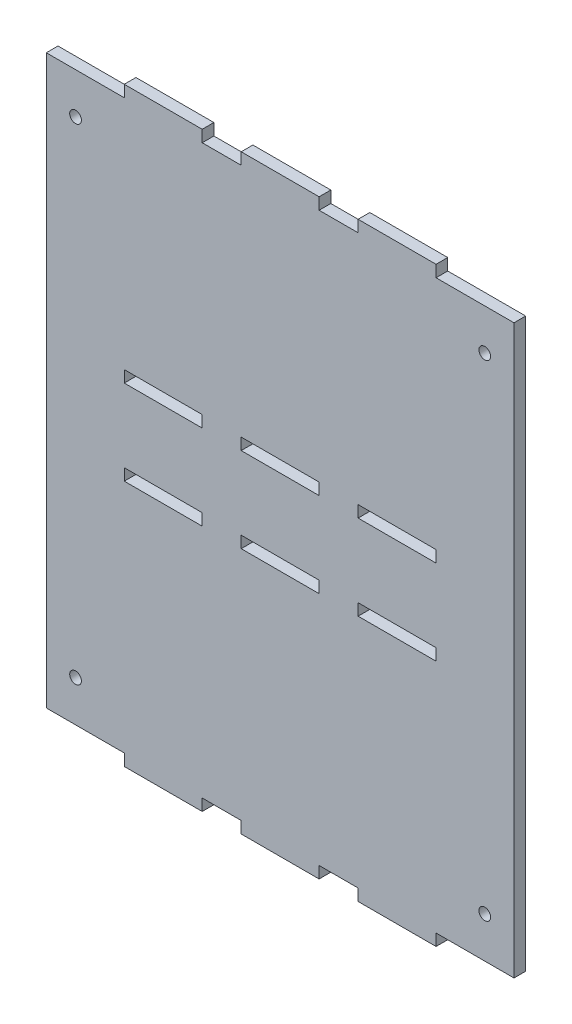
ISO-10303-21;
HEADER;
FILE_DESCRIPTION(('STEP AP214'),'2;1');
FILE_NAME('part.step','',(''),(''),'','','');
FILE_SCHEMA(('AUTOMOTIVE_DESIGN { 1 0 10303 214 1 1 1 1 }'));
ENDSEC;
DATA;
#1=APPLICATION_CONTEXT('core data for automotive mechanical design processes');
#2=APPLICATION_PROTOCOL_DEFINITION('international standard','automotive_design',2000,#1);
#3=PRODUCT_CONTEXT('',#1,'mechanical');
#4=PRODUCT('Part','Part','',(#3));
#5=PRODUCT_RELATED_PRODUCT_CATEGORY('part','',(#4));
#6=PRODUCT_DEFINITION_FORMATION('','',#4);
#7=PRODUCT_DEFINITION_CONTEXT('part definition',#1,'design');
#8=PRODUCT_DEFINITION('design','',#6,#7);
#9=PRODUCT_DEFINITION_SHAPE('','',#8);
#10=(LENGTH_UNIT() NAMED_UNIT(*) SI_UNIT(.MILLI.,.METRE.));
#11=(NAMED_UNIT(*) PLANE_ANGLE_UNIT() SI_UNIT($,.RADIAN.));
#12=(NAMED_UNIT(*) SI_UNIT($,.STERADIAN.) SOLID_ANGLE_UNIT());
#13=UNCERTAINTY_MEASURE_WITH_UNIT(LENGTH_MEASURE(1.E-05),#10,'distance_accuracy_value','');
#14=(GEOMETRIC_REPRESENTATION_CONTEXT(3) GLOBAL_UNCERTAINTY_ASSIGNED_CONTEXT((#13)) GLOBAL_UNIT_ASSIGNED_CONTEXT((#10,
#11,#12)) REPRESENTATION_CONTEXT('',''));
#15=CARTESIAN_POINT('',(0.,0.,0.));
#16=DIRECTION('',(0.,0.,1.));
#17=DIRECTION('',(1.,0.,0.));
#18=AXIS2_PLACEMENT_3D('',#15,#16,#17);
#19=CARTESIAN_POINT('',(20.,0.,3.));
#20=DIRECTION('',(-1.,0.,0.));
#21=DIRECTION('',(0.,0.,1.));
#22=AXIS2_PLACEMENT_3D('',#19,#20,#21);
#23=PLANE('',#22);
#24=DIRECTION('',(0.,1.,0.));
#25=VECTOR('',#24,1.);
#26=CARTESIAN_POINT('',(20.,0.,0.));
#27=LINE('',#26,#25);
#28=CARTESIAN_POINT('',(20.,-88.2000000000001,0.));
#29=VERTEX_POINT('',#28);
#30=CARTESIAN_POINT('',(20.,-85.2000000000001,0.));
#31=VERTEX_POINT('',#30);
#32=EDGE_CURVE('E552',#29,#31,#27,.T.);
#33=ORIENTED_EDGE('',*,*,#32,.T.);
#34=DIRECTION('',(0.,0.,-1.));
#35=VECTOR('',#34,1.);
#36=CARTESIAN_POINT('',(20.,-85.2000000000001,3.));
#37=LINE('',#36,#35);
#38=CARTESIAN_POINT('',(20.,-85.2000000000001,3.));
#39=VERTEX_POINT('',#38);
#40=EDGE_CURVE('E11',#39,#31,#37,.T.);
#41=ORIENTED_EDGE('',*,*,#40,.F.);
#42=DIRECTION('',(0.,1.,0.));
#43=VECTOR('',#42,1.);
#44=CARTESIAN_POINT('',(20.,0.,3.));
#45=LINE('',#44,#43);
#46=CARTESIAN_POINT('',(20.,-88.2000000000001,3.));
#47=VERTEX_POINT('',#46);
#48=EDGE_CURVE('E385',#47,#39,#45,.T.);
#49=ORIENTED_EDGE('',*,*,#48,.F.);
#50=DIRECTION('',(0.,0.,-1.));
#51=VECTOR('',#50,1.);
#52=CARTESIAN_POINT('',(20.,-88.2000000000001,3.));
#53=LINE('',#52,#51);
#54=EDGE_CURVE('E562',#47,#29,#53,.T.);
#55=ORIENTED_EDGE('',*,*,#54,.T.);
#56=EDGE_LOOP('',(#33,#41,#49,#55));
#57=FACE_BOUND('',#56,.T.);
#58=ADVANCED_FACE('F39',(#57),#23,.F.);
#59=CARTESIAN_POINT('',(2.36477504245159E-13,-85.2000000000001,3.));
#60=DIRECTION('',(0.,1.,0.));
#61=DIRECTION('',(-1.,0.,0.));
#62=AXIS2_PLACEMENT_3D('',#59,#60,#61);
#63=PLANE('',#62);
#64=DIRECTION('',(1.,0.,0.));
#65=VECTOR('',#64,1.);
#66=CARTESIAN_POINT('',(2.36477504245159E-13,-85.2000000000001,0.));
#67=LINE('',#66,#65);
#68=CARTESIAN_POINT('',(40.,-85.2,0.));
#69=VERTEX_POINT('',#68);
#70=EDGE_CURVE('E390',#31,#69,#67,.T.);
#71=ORIENTED_EDGE('',*,*,#70,.T.);
#72=DIRECTION('',(0.,0.,-1.));
#73=VECTOR('',#72,1.);
#74=CARTESIAN_POINT('',(40.,-85.2,3.));
#75=LINE('',#74,#73);
#76=CARTESIAN_POINT('',(40.,-85.2,3.));
#77=VERTEX_POINT('',#76);
#78=EDGE_CURVE('E49',#77,#69,#75,.T.);
#79=ORIENTED_EDGE('',*,*,#78,.F.);
#80=DIRECTION('',(1.,0.,0.));
#81=VECTOR('',#80,1.);
#82=CARTESIAN_POINT('',(2.36477504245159E-13,-85.2000000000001,3.));
#83=LINE('',#82,#81);
#84=EDGE_CURVE('E378',#39,#77,#83,.T.);
#85=ORIENTED_EDGE('',*,*,#84,.F.);
#86=ORIENTED_EDGE('',*,*,#40,.T.);
#87=EDGE_LOOP('',(#71,#79,#85,#86));
#88=FACE_BOUND('',#87,.T.);
#89=ADVANCED_FACE('F389',(#88),#63,.F.);
#90=CARTESIAN_POINT('',(39.9999999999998,0.,3.));
#91=DIRECTION('',(1.,0.,0.));
#92=DIRECTION('',(0.,1.,0.));
#93=AXIS2_PLACEMENT_3D('',#90,#91,#92);
#94=PLANE('',#93);
#95=DIRECTION('',(0.,-1.,0.));
#96=VECTOR('',#95,1.);
#97=CARTESIAN_POINT('',(39.9999999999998,0.,0.));
#98=LINE('',#97,#96);
#99=CARTESIAN_POINT('',(40.,-88.2000000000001,0.));
#100=VERTEX_POINT('',#99);
#101=EDGE_CURVE('E219',#69,#100,#98,.T.);
#102=ORIENTED_EDGE('',*,*,#101,.T.);
#103=DIRECTION('',(0.,0.,-1.));
#104=VECTOR('',#103,1.);
#105=CARTESIAN_POINT('',(40.,-88.2000000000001,3.));
#106=LINE('',#105,#104);
#107=CARTESIAN_POINT('',(40.,-88.2000000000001,3.));
#108=VERTEX_POINT('',#107);
#109=EDGE_CURVE('E391',#108,#100,#106,.T.);
#110=ORIENTED_EDGE('',*,*,#109,.F.);
#111=DIRECTION('',(0.,-1.,0.));
#112=VECTOR('',#111,1.);
#113=CARTESIAN_POINT('',(39.9999999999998,0.,3.));
#114=LINE('',#113,#112);
#115=EDGE_CURVE('E383',#77,#108,#114,.T.);
#116=ORIENTED_EDGE('',*,*,#115,.F.);
#117=ORIENTED_EDGE('',*,*,#78,.T.);
#118=EDGE_LOOP('',(#102,#110,#116,#117));
#119=FACE_BOUND('',#118,.T.);
#120=ADVANCED_FACE('F393',(#119),#94,.F.);
#121=CARTESIAN_POINT('',(-20.,0.,3.));
#122=DIRECTION('',(1.,0.,0.));
#123=DIRECTION('',(0.,0.,-1.));
#124=AXIS2_PLACEMENT_3D('',#121,#122,#123);
#125=PLANE('',#124);
#126=DIRECTION('',(0.,-1.,0.));
#127=VECTOR('',#126,1.);
#128=CARTESIAN_POINT('',(-20.,0.,0.));
#129=LINE('',#128,#127);
#130=CARTESIAN_POINT('',(-20.,-63.4,0.));
#131=VERTEX_POINT('',#130);
#132=CARTESIAN_POINT('',(-20.,-66.4,0.));
#133=VERTEX_POINT('',#132);
#134=EDGE_CURVE('E543',#131,#133,#129,.T.);
#135=ORIENTED_EDGE('',*,*,#134,.T.);
#136=DIRECTION('',(0.,0.,-1.));
#137=VECTOR('',#136,1.);
#138=CARTESIAN_POINT('',(-20.,-66.4,3.));
#139=LINE('',#138,#137);
#140=CARTESIAN_POINT('',(-20.,-66.4,3.));
#141=VERTEX_POINT('',#140);
#142=EDGE_CURVE('E564',#141,#133,#139,.T.);
#143=ORIENTED_EDGE('',*,*,#142,.F.);
#144=DIRECTION('',(0.,-1.,0.));
#145=VECTOR('',#144,1.);
#146=CARTESIAN_POINT('',(-20.,0.,3.));
#147=LINE('',#146,#145);
#148=CARTESIAN_POINT('',(-20.,-63.4,3.));
#149=VERTEX_POINT('',#148);
#150=EDGE_CURVE('E820',#149,#141,#147,.T.);
#151=ORIENTED_EDGE('',*,*,#150,.F.);
#152=DIRECTION('',(0.,0.,-1.));
#153=VECTOR('',#152,1.);
#154=CARTESIAN_POINT('',(-20.,-63.4,3.));
#155=LINE('',#154,#153);
#156=EDGE_CURVE('E566',#149,#131,#155,.T.);
#157=ORIENTED_EDGE('',*,*,#156,.T.);
#158=EDGE_LOOP('',(#135,#143,#151,#157));
#159=FACE_BOUND('',#158,.T.);
#160=ADVANCED_FACE('F840',(#159),#125,.F.);
#161=CARTESIAN_POINT('',(1.84297022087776E-13,-66.3999999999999,3.));
#162=DIRECTION('',(0.,-1.,0.));
#163=DIRECTION('',(1.,0.,0.));
#164=AXIS2_PLACEMENT_3D('',#161,#162,#163);
#165=PLANE('',#164);
#166=DIRECTION('',(-1.,0.,0.));
#167=VECTOR('',#166,1.);
#168=CARTESIAN_POINT('',(1.84297022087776E-13,-66.3999999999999,0.));
#169=LINE('',#168,#167);
#170=CARTESIAN_POINT('',(-40.,-66.4,0.));
#171=VERTEX_POINT('',#170);
#172=EDGE_CURVE('E546',#133,#171,#169,.T.);
#173=ORIENTED_EDGE('',*,*,#172,.T.);
#174=DIRECTION('',(0.,0.,-1.));
#175=VECTOR('',#174,1.);
#176=CARTESIAN_POINT('',(-40.,-66.4,3.));
#177=LINE('',#176,#175);
#178=CARTESIAN_POINT('',(-40.,-66.4,3.));
#179=VERTEX_POINT('',#178);
#180=EDGE_CURVE('E573',#179,#171,#177,.T.);
#181=ORIENTED_EDGE('',*,*,#180,.F.);
#182=DIRECTION('',(-1.,0.,0.));
#183=VECTOR('',#182,1.);
#184=CARTESIAN_POINT('',(1.84297022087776E-13,-66.3999999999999,3.));
#185=LINE('',#184,#183);
#186=EDGE_CURVE('E823',#141,#179,#185,.T.);
#187=ORIENTED_EDGE('',*,*,#186,.F.);
#188=ORIENTED_EDGE('',*,*,#142,.T.);
#189=EDGE_LOOP('',(#173,#181,#187,#188));
#190=FACE_BOUND('',#189,.T.);
#191=ADVANCED_FACE('F842',(#190),#165,.F.);
#192=CARTESIAN_POINT('',(-40.0000000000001,0.,3.));
#193=DIRECTION('',(-1.,0.,0.));
#194=DIRECTION('',(0.,-1.,0.));
#195=AXIS2_PLACEMENT_3D('',#192,#193,#194);
#196=PLANE('',#195);
#197=DIRECTION('',(0.,1.,0.));
#198=VECTOR('',#197,1.);
#199=CARTESIAN_POINT('',(-40.0000000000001,0.,0.));
#200=LINE('',#199,#198);
#201=CARTESIAN_POINT('',(-40.,-63.4,0.));
#202=VERTEX_POINT('',#201);
#203=EDGE_CURVE('E548',#171,#202,#200,.T.);
#204=ORIENTED_EDGE('',*,*,#203,.T.);
#205=DIRECTION('',(0.,0.,-1.));
#206=VECTOR('',#205,1.);
#207=CARTESIAN_POINT('',(-40.,-63.4,3.));
#208=LINE('',#207,#206);
#209=CARTESIAN_POINT('',(-40.,-63.4,3.));
#210=VERTEX_POINT('',#209);
#211=EDGE_CURVE('E569',#210,#202,#208,.T.);
#212=ORIENTED_EDGE('',*,*,#211,.F.);
#213=DIRECTION('',(0.,1.,0.));
#214=VECTOR('',#213,1.);
#215=CARTESIAN_POINT('',(-40.0000000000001,0.,3.));
#216=LINE('',#215,#214);
#217=EDGE_CURVE('E825',#179,#210,#216,.T.);
#218=ORIENTED_EDGE('',*,*,#217,.F.);
#219=ORIENTED_EDGE('',*,*,#180,.T.);
#220=EDGE_LOOP('',(#204,#212,#218,#219));
#221=FACE_BOUND('',#220,.T.);
#222=ADVANCED_FACE('F846',(#221),#196,.F.);
#223=CARTESIAN_POINT('',(-1.38222766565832E-13,-66.3999999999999,3.));
#224=DIRECTION('',(0.,1.,0.));
#225=DIRECTION('',(-1.,0.,0.));
#226=AXIS2_PLACEMENT_3D('',#223,#224,#225);
#227=PLANE('',#226);
#228=DIRECTION('',(1.,0.,0.));
#229=VECTOR('',#228,1.);
#230=CARTESIAN_POINT('',(-1.38222766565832E-13,-66.3999999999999,0.));
#231=LINE('',#230,#229);
#232=CARTESIAN_POINT('',(20.,-66.4,0.));
#233=VERTEX_POINT('',#232);
#234=CARTESIAN_POINT('',(40.,-66.4,0.));
#235=VERTEX_POINT('',#234);
#236=EDGE_CURVE('E531',#233,#235,#231,.T.);
#237=ORIENTED_EDGE('',*,*,#236,.F.);
#238=DIRECTION('',(0.,0.,-1.));
#239=VECTOR('',#238,1.);
#240=CARTESIAN_POINT('',(20.,-66.4,3.));
#241=LINE('',#240,#239);
#242=CARTESIAN_POINT('',(20.,-66.4,3.));
#243=VERTEX_POINT('',#242);
#244=EDGE_CURVE('E570',#243,#233,#241,.T.);
#245=ORIENTED_EDGE('',*,*,#244,.F.);
#246=DIRECTION('',(1.,0.,0.));
#247=VECTOR('',#246,1.);
#248=CARTESIAN_POINT('',(-1.38222766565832E-13,-66.3999999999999,3.));
#249=LINE('',#248,#247);
#250=CARTESIAN_POINT('',(40.,-66.4,3.));
#251=VERTEX_POINT('',#250);
#252=EDGE_CURVE('E808',#243,#251,#249,.T.);
#253=ORIENTED_EDGE('',*,*,#252,.T.);
#254=DIRECTION('',(0.,0.,-1.));
#255=VECTOR('',#254,1.);
#256=CARTESIAN_POINT('',(40.,-66.4,3.));
#257=LINE('',#256,#255);
#258=EDGE_CURVE('E578',#251,#235,#257,.T.);
#259=ORIENTED_EDGE('',*,*,#258,.T.);
#260=EDGE_LOOP('',(#237,#245,#253,#259));
#261=FACE_BOUND('',#260,.T.);
#262=ADVANCED_FACE('F885',(#261),#227,.T.);
#263=CARTESIAN_POINT('',(20.,0.,3.));
#264=DIRECTION('',(1.,0.,0.));
#265=DIRECTION('',(0.,0.,-1.));
#266=AXIS2_PLACEMENT_3D('',#263,#264,#265);
#267=PLANE('',#266);
#268=DIRECTION('',(0.,-1.,0.));
#269=VECTOR('',#268,1.);
#270=CARTESIAN_POINT('',(20.,0.,0.));
#271=LINE('',#270,#269);
#272=CARTESIAN_POINT('',(20.,-63.4,0.));
#273=VERTEX_POINT('',#272);
#274=EDGE_CURVE('E534',#273,#233,#271,.T.);
#275=ORIENTED_EDGE('',*,*,#274,.F.);
#276=DIRECTION('',(0.,0.,-1.));
#277=VECTOR('',#276,1.);
#278=CARTESIAN_POINT('',(20.,-63.4,3.));
#279=LINE('',#278,#277);
#280=CARTESIAN_POINT('',(20.,-63.4,3.));
#281=VERTEX_POINT('',#280);
#282=EDGE_CURVE('E583',#281,#273,#279,.T.);
#283=ORIENTED_EDGE('',*,*,#282,.F.);
#284=DIRECTION('',(0.,-1.,0.));
#285=VECTOR('',#284,1.);
#286=CARTESIAN_POINT('',(20.,0.,3.));
#287=LINE('',#286,#285);
#288=EDGE_CURVE('E811',#281,#243,#287,.T.);
#289=ORIENTED_EDGE('',*,*,#288,.T.);
#290=ORIENTED_EDGE('',*,*,#244,.T.);
#291=EDGE_LOOP('',(#275,#283,#289,#290));
#292=FACE_BOUND('',#291,.T.);
#293=ADVANCED_FACE('F898',(#292),#267,.T.);
#294=CARTESIAN_POINT('',(0.,-63.4,3.));
#295=DIRECTION('',(0.,-1.,0.));
#296=DIRECTION('',(0.,0.,-1.));
#297=AXIS2_PLACEMENT_3D('',#294,#295,#296);
#298=PLANE('',#297);
#299=DIRECTION('',(-1.,0.,0.));
#300=VECTOR('',#299,1.);
#301=CARTESIAN_POINT('',(0.,-63.4,0.));
#302=LINE('',#301,#300);
#303=CARTESIAN_POINT('',(40.,-63.4,0.));
#304=VERTEX_POINT('',#303);
#305=EDGE_CURVE('E537',#304,#273,#302,.T.);
#306=ORIENTED_EDGE('',*,*,#305,.F.);
#307=DIRECTION('',(0.,0.,-1.));
#308=VECTOR('',#307,1.);
#309=CARTESIAN_POINT('',(40.,-63.4,3.));
#310=LINE('',#309,#308);
#311=CARTESIAN_POINT('',(40.,-63.4,3.));
#312=VERTEX_POINT('',#311);
#313=EDGE_CURVE('E580',#312,#304,#310,.T.);
#314=ORIENTED_EDGE('',*,*,#313,.F.);
#315=DIRECTION('',(-1.,0.,0.));
#316=VECTOR('',#315,1.);
#317=CARTESIAN_POINT('',(0.,-63.4,3.));
#318=LINE('',#317,#316);
#319=EDGE_CURVE('E814',#312,#281,#318,.T.);
#320=ORIENTED_EDGE('',*,*,#319,.T.);
#321=ORIENTED_EDGE('',*,*,#282,.T.);
#322=EDGE_LOOP('',(#306,#314,#320,#321));
#323=FACE_BOUND('',#322,.T.);
#324=ADVANCED_FACE('F894',(#323),#298,.T.);
#325=CARTESIAN_POINT('',(-10.0000000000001,0.,3.));
#326=DIRECTION('',(1.,0.,0.));
#327=DIRECTION('',(0.,1.,0.));
#328=AXIS2_PLACEMENT_3D('',#325,#326,#327);
#329=PLANE('',#328);
#330=DIRECTION('',(0.,-1.,0.));
#331=VECTOR('',#330,1.);
#332=CARTESIAN_POINT('',(-10.0000000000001,0.,0.));
#333=LINE('',#332,#331);
#334=CARTESIAN_POINT('',(-9.99999999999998,-63.4,0.));
#335=VERTEX_POINT('',#334);
#336=CARTESIAN_POINT('',(-9.99999999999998,-66.4,0.));
#337=VERTEX_POINT('',#336);
#338=EDGE_CURVE('E519',#335,#337,#333,.T.);
#339=ORIENTED_EDGE('',*,*,#338,.F.);
#340=DIRECTION('',(0.,0.,-1.));
#341=VECTOR('',#340,1.);
#342=CARTESIAN_POINT('',(-9.99999999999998,-63.4,3.));
#343=LINE('',#342,#341);
#344=CARTESIAN_POINT('',(-9.99999999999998,-63.4,3.));
#345=VERTEX_POINT('',#344);
#346=EDGE_CURVE('E581',#345,#335,#343,.T.);
#347=ORIENTED_EDGE('',*,*,#346,.F.);
#348=DIRECTION('',(0.,-1.,0.));
#349=VECTOR('',#348,1.);
#350=CARTESIAN_POINT('',(-10.0000000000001,0.,3.));
#351=LINE('',#350,#349);
#352=CARTESIAN_POINT('',(-9.99999999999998,-66.4,3.));
#353=VERTEX_POINT('',#352);
#354=EDGE_CURVE('E797',#345,#353,#351,.T.);
#355=ORIENTED_EDGE('',*,*,#354,.T.);
#356=DIRECTION('',(0.,0.,-1.));
#357=VECTOR('',#356,1.);
#358=CARTESIAN_POINT('',(-9.99999999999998,-66.4,3.));
#359=LINE('',#358,#357);
#360=EDGE_CURVE('E586',#353,#337,#359,.T.);
#361=ORIENTED_EDGE('',*,*,#360,.T.);
#362=EDGE_LOOP('',(#339,#347,#355,#361));
#363=FACE_BOUND('',#362,.T.);
#364=ADVANCED_FACE('F897',(#363),#329,.T.);
#365=CARTESIAN_POINT('',(0.,-63.4,3.));
#366=DIRECTION('',(0.,-1.,0.));
#367=DIRECTION('',(0.,0.,-1.));
#368=AXIS2_PLACEMENT_3D('',#365,#366,#367);
#369=PLANE('',#368);
#370=DIRECTION('',(-1.,0.,0.));
#371=VECTOR('',#370,1.);
#372=CARTESIAN_POINT('',(0.,-63.4,0.));
#373=LINE('',#372,#371);
#374=CARTESIAN_POINT('',(9.99999999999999,-63.4,0.));
#375=VERTEX_POINT('',#374);
#376=EDGE_CURVE('E522',#375,#335,#373,.T.);
#377=ORIENTED_EDGE('',*,*,#376,.F.);
#378=DIRECTION('',(0.,0.,-1.));
#379=VECTOR('',#378,1.);
#380=CARTESIAN_POINT('',(9.99999999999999,-63.4,3.));
#381=LINE('',#380,#379);
#382=CARTESIAN_POINT('',(9.99999999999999,-63.4,3.));
#383=VERTEX_POINT('',#382);
#384=EDGE_CURVE('E592',#383,#375,#381,.T.);
#385=ORIENTED_EDGE('',*,*,#384,.F.);
#386=DIRECTION('',(-1.,0.,0.));
#387=VECTOR('',#386,1.);
#388=CARTESIAN_POINT('',(0.,-63.4,3.));
#389=LINE('',#388,#387);
#390=EDGE_CURVE('E800',#383,#345,#389,.T.);
#391=ORIENTED_EDGE('',*,*,#390,.T.);
#392=ORIENTED_EDGE('',*,*,#346,.T.);
#393=EDGE_LOOP('',(#377,#385,#391,#392));
#394=FACE_BOUND('',#393,.T.);
#395=ADVANCED_FACE('F914',(#394),#369,.T.);
#396=CARTESIAN_POINT('',(9.99999999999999,0.,3.));
#397=DIRECTION('',(1.,0.,0.));
#398=DIRECTION('',(0.,0.,-1.));
#399=AXIS2_PLACEMENT_3D('',#396,#397,#398);
#400=PLANE('',#399);
#401=DIRECTION('',(0.,-1.,0.));
#402=VECTOR('',#401,1.);
#403=CARTESIAN_POINT('',(9.99999999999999,0.,0.));
#404=LINE('',#403,#402);
#405=CARTESIAN_POINT('',(9.99999999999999,-66.4,0.));
#406=VERTEX_POINT('',#405);
#407=EDGE_CURVE('E525',#375,#406,#404,.T.);
#408=ORIENTED_EDGE('',*,*,#407,.T.);
#409=DIRECTION('',(0.,0.,-1.));
#410=VECTOR('',#409,1.);
#411=CARTESIAN_POINT('',(9.99999999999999,-66.4,3.));
#412=LINE('',#411,#410);
#413=CARTESIAN_POINT('',(9.99999999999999,-66.4,3.));
#414=VERTEX_POINT('',#413);
#415=EDGE_CURVE('E588',#414,#406,#412,.T.);
#416=ORIENTED_EDGE('',*,*,#415,.F.);
#417=DIRECTION('',(0.,-1.,0.));
#418=VECTOR('',#417,1.);
#419=CARTESIAN_POINT('',(9.99999999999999,0.,3.));
#420=LINE('',#419,#418);
#421=EDGE_CURVE('E803',#383,#414,#420,.T.);
#422=ORIENTED_EDGE('',*,*,#421,.F.);
#423=ORIENTED_EDGE('',*,*,#384,.T.);
#424=EDGE_LOOP('',(#408,#416,#422,#423));
#425=FACE_BOUND('',#424,.T.);
#426=ADVANCED_FACE('F910',(#425),#400,.F.);
#427=CARTESIAN_POINT('',(-20.,0.,3.));
#428=DIRECTION('',(-1.,0.,0.));
#429=DIRECTION('',(0.,0.,1.));
#430=AXIS2_PLACEMENT_3D('',#427,#428,#429);
#431=PLANE('',#430);
#432=DIRECTION('',(0.,1.,0.));
#433=VECTOR('',#432,1.);
#434=CARTESIAN_POINT('',(-20.,0.,0.));
#435=LINE('',#434,#433);
#436=CARTESIAN_POINT('',(-20.,-88.2000000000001,0.));
#437=VERTEX_POINT('',#436);
#438=CARTESIAN_POINT('',(-20.,-85.2000000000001,0.));
#439=VERTEX_POINT('',#438);
#440=EDGE_CURVE('E507',#437,#439,#435,.T.);
#441=ORIENTED_EDGE('',*,*,#440,.F.);
#442=DIRECTION('',(0.,0.,-1.));
#443=VECTOR('',#442,1.);
#444=CARTESIAN_POINT('',(-20.,-88.2000000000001,3.));
#445=LINE('',#444,#443);
#446=CARTESIAN_POINT('',(-20.,-88.2000000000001,3.));
#447=VERTEX_POINT('',#446);
#448=EDGE_CURVE('E589',#447,#437,#445,.T.);
#449=ORIENTED_EDGE('',*,*,#448,.F.);
#450=DIRECTION('',(0.,1.,0.));
#451=VECTOR('',#450,1.);
#452=CARTESIAN_POINT('',(-20.,0.,3.));
#453=LINE('',#452,#451);
#454=CARTESIAN_POINT('',(-20.,-85.2000000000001,3.));
#455=VERTEX_POINT('',#454);
#456=EDGE_CURVE('E785',#447,#455,#453,.T.);
#457=ORIENTED_EDGE('',*,*,#456,.T.);
#458=DIRECTION('',(0.,0.,-1.));
#459=VECTOR('',#458,1.);
#460=CARTESIAN_POINT('',(-20.,-85.2000000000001,3.));
#461=LINE('',#460,#459);
#462=EDGE_CURVE('E595',#455,#439,#461,.T.);
#463=ORIENTED_EDGE('',*,*,#462,.T.);
#464=EDGE_LOOP('',(#441,#449,#457,#463));
#465=FACE_BOUND('',#464,.T.);
#466=ADVANCED_FACE('F913',(#465),#431,.T.);
#467=CARTESIAN_POINT('',(0.,-88.2000000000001,3.));
#468=DIRECTION('',(0.,1.,0.));
#469=DIRECTION('',(-1.,0.,0.));
#470=AXIS2_PLACEMENT_3D('',#467,#468,#469);
#471=PLANE('',#470);
#472=DIRECTION('',(1.,0.,0.));
#473=VECTOR('',#472,1.);
#474=CARTESIAN_POINT('',(0.,-88.2000000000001,0.));
#475=LINE('',#474,#473);
#476=CARTESIAN_POINT('',(-40.,-88.2000000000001,0.));
#477=VERTEX_POINT('',#476);
#478=EDGE_CURVE('E510',#477,#437,#475,.T.);
#479=ORIENTED_EDGE('',*,*,#478,.F.);
#480=DIRECTION('',(0.,0.,-1.));
#481=VECTOR('',#480,1.);
#482=CARTESIAN_POINT('',(-40.,-88.2000000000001,3.));
#483=LINE('',#482,#481);
#484=CARTESIAN_POINT('',(-40.,-88.2000000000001,3.));
#485=VERTEX_POINT('',#484);
#486=EDGE_CURVE('E600',#485,#477,#483,.T.);
#487=ORIENTED_EDGE('',*,*,#486,.F.);
#488=DIRECTION('',(1.,0.,0.));
#489=VECTOR('',#488,1.);
#490=CARTESIAN_POINT('',(0.,-88.2000000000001,3.));
#491=LINE('',#490,#489);
#492=EDGE_CURVE('E788',#485,#447,#491,.T.);
#493=ORIENTED_EDGE('',*,*,#492,.T.);
#494=ORIENTED_EDGE('',*,*,#448,.T.);
#495=EDGE_LOOP('',(#479,#487,#493,#494));
#496=FACE_BOUND('',#495,.T.);
#497=ADVANCED_FACE('F930',(#496),#471,.T.);
#498=CARTESIAN_POINT('',(-39.9999999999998,0.,3.));
#499=DIRECTION('',(1.,0.,0.));
#500=DIRECTION('',(0.,1.,0.));
#501=AXIS2_PLACEMENT_3D('',#498,#499,#500);
#502=PLANE('',#501);
#503=DIRECTION('',(0.,-1.,0.));
#504=VECTOR('',#503,1.);
#505=CARTESIAN_POINT('',(-39.9999999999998,0.,0.));
#506=LINE('',#505,#504);
#507=CARTESIAN_POINT('',(-40.,-85.2,0.));
#508=VERTEX_POINT('',#507);
#509=EDGE_CURVE('E513',#508,#477,#506,.T.);
#510=ORIENTED_EDGE('',*,*,#509,.F.);
#511=DIRECTION('',(0.,0.,-1.));
#512=VECTOR('',#511,1.);
#513=CARTESIAN_POINT('',(-40.,-85.2,3.));
#514=LINE('',#513,#512);
#515=CARTESIAN_POINT('',(-40.,-85.2,3.));
#516=VERTEX_POINT('',#515);
#517=EDGE_CURVE('E597',#516,#508,#514,.T.);
#518=ORIENTED_EDGE('',*,*,#517,.F.);
#519=DIRECTION('',(0.,-1.,0.));
#520=VECTOR('',#519,1.);
#521=CARTESIAN_POINT('',(-39.9999999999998,0.,3.));
#522=LINE('',#521,#520);
#523=EDGE_CURVE('E791',#516,#485,#522,.T.);
#524=ORIENTED_EDGE('',*,*,#523,.T.);
#525=ORIENTED_EDGE('',*,*,#486,.T.);
#526=EDGE_LOOP('',(#510,#518,#524,#525));
#527=FACE_BOUND('',#526,.T.);
#528=ADVANCED_FACE('F926',(#527),#502,.T.);
#529=CARTESIAN_POINT('',(0.,-85.2000000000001,3.));
#530=DIRECTION('',(0.,-1.,0.));
#531=DIRECTION('',(0.,0.,-1.));
#532=AXIS2_PLACEMENT_3D('',#529,#530,#531);
#533=PLANE('',#532);
#534=DIRECTION('',(-1.,0.,0.));
#535=VECTOR('',#534,1.);
#536=CARTESIAN_POINT('',(0.,-85.2000000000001,0.));
#537=LINE('',#536,#535);
#538=CARTESIAN_POINT('',(10.,-85.2000000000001,0.));
#539=VERTEX_POINT('',#538);
#540=CARTESIAN_POINT('',(-9.99999999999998,-85.2000000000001,0.));
#541=VERTEX_POINT('',#540);
#542=EDGE_CURVE('E495',#539,#541,#537,.T.);
#543=ORIENTED_EDGE('',*,*,#542,.F.);
#544=DIRECTION('',(0.,0.,-1.));
#545=VECTOR('',#544,1.);
#546=CARTESIAN_POINT('',(10.,-85.2000000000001,3.));
#547=LINE('',#546,#545);
#548=CARTESIAN_POINT('',(10.,-85.2000000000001,3.));
#549=VERTEX_POINT('',#548);
#550=EDGE_CURVE('E598',#549,#539,#547,.T.);
#551=ORIENTED_EDGE('',*,*,#550,.F.);
#552=DIRECTION('',(-1.,0.,0.));
#553=VECTOR('',#552,1.);
#554=CARTESIAN_POINT('',(0.,-85.2000000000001,3.));
#555=LINE('',#554,#553);
#556=CARTESIAN_POINT('',(-9.99999999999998,-85.2000000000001,3.));
#557=VERTEX_POINT('',#556);
#558=EDGE_CURVE('E774',#549,#557,#555,.T.);
#559=ORIENTED_EDGE('',*,*,#558,.T.);
#560=DIRECTION('',(0.,0.,-1.));
#561=VECTOR('',#560,1.);
#562=CARTESIAN_POINT('',(-9.99999999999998,-85.2000000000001,3.));
#563=LINE('',#562,#561);
#564=EDGE_CURVE('E603',#557,#541,#563,.T.);
#565=ORIENTED_EDGE('',*,*,#564,.T.);
#566=EDGE_LOOP('',(#543,#551,#559,#565));
#567=FACE_BOUND('',#566,.T.);
#568=ADVANCED_FACE('F929',(#567),#533,.T.);
#569=CARTESIAN_POINT('',(9.99999999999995,0.,3.));
#570=DIRECTION('',(-1.,0.,0.));
#571=DIRECTION('',(0.,-1.,0.));
#572=AXIS2_PLACEMENT_3D('',#569,#570,#571);
#573=PLANE('',#572);
#574=DIRECTION('',(0.,1.,0.));
#575=VECTOR('',#574,1.);
#576=CARTESIAN_POINT('',(9.99999999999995,0.,0.));
#577=LINE('',#576,#575);
#578=CARTESIAN_POINT('',(10.,-88.2000000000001,0.));
#579=VERTEX_POINT('',#578);
#580=EDGE_CURVE('E498',#579,#539,#577,.T.);
#581=ORIENTED_EDGE('',*,*,#580,.F.);
#582=DIRECTION('',(0.,0.,-1.));
#583=VECTOR('',#582,1.);
#584=CARTESIAN_POINT('',(10.,-88.2000000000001,3.));
#585=LINE('',#584,#583);
#586=CARTESIAN_POINT('',(10.,-88.2000000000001,3.));
#587=VERTEX_POINT('',#586);
#588=EDGE_CURVE('E608',#587,#579,#585,.T.);
#589=ORIENTED_EDGE('',*,*,#588,.F.);
#590=DIRECTION('',(0.,1.,0.));
#591=VECTOR('',#590,1.);
#592=CARTESIAN_POINT('',(9.99999999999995,0.,3.));
#593=LINE('',#592,#591);
#594=EDGE_CURVE('E777',#587,#549,#593,.T.);
#595=ORIENTED_EDGE('',*,*,#594,.T.);
#596=ORIENTED_EDGE('',*,*,#550,.T.);
#597=EDGE_LOOP('',(#581,#589,#595,#596));
#598=FACE_BOUND('',#597,.T.);
#599=ADVANCED_FACE('F945',(#598),#573,.T.);
#600=CARTESIAN_POINT('',(0.,-88.2000000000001,3.));
#601=DIRECTION('',(0.,-1.,0.));
#602=DIRECTION('',(0.,0.,-1.));
#603=AXIS2_PLACEMENT_3D('',#600,#601,#602);
#604=PLANE('',#603);
#605=DIRECTION('',(-1.,0.,0.));
#606=VECTOR('',#605,1.);
#607=CARTESIAN_POINT('',(0.,-88.2000000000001,0.));
#608=LINE('',#607,#606);
#609=CARTESIAN_POINT('',(-9.99999999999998,-88.2000000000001,0.));
#610=VERTEX_POINT('',#609);
#611=EDGE_CURVE('E501',#579,#610,#608,.T.);
#612=ORIENTED_EDGE('',*,*,#611,.T.);
#613=DIRECTION('',(0.,0.,-1.));
#614=VECTOR('',#613,1.);
#615=CARTESIAN_POINT('',(-9.99999999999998,-88.2000000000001,3.));
#616=LINE('',#615,#614);
#617=CARTESIAN_POINT('',(-9.99999999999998,-88.2000000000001,3.));
#618=VERTEX_POINT('',#617);
#619=EDGE_CURVE('E605',#618,#610,#616,.T.);
#620=ORIENTED_EDGE('',*,*,#619,.F.);
#621=DIRECTION('',(-1.,0.,0.));
#622=VECTOR('',#621,1.);
#623=CARTESIAN_POINT('',(0.,-88.2000000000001,3.));
#624=LINE('',#623,#622);
#625=EDGE_CURVE('E780',#587,#618,#624,.T.);
#626=ORIENTED_EDGE('',*,*,#625,.F.);
#627=ORIENTED_EDGE('',*,*,#588,.T.);
#628=EDGE_LOOP('',(#612,#620,#626,#627));
#629=FACE_BOUND('',#628,.T.);
#630=ADVANCED_FACE('F942',(#629),#604,.F.);
#631=CARTESIAN_POINT('',(-2.06223926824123E-13,-148.6,3.));
#632=DIRECTION('',(0.,-1.,0.));
#633=DIRECTION('',(1.,0.,0.));
#634=AXIS2_PLACEMENT_3D('',#631,#632,#633);
#635=PLANE('',#634);
#636=DIRECTION('',(-1.,0.,0.));
#637=VECTOR('',#636,1.);
#638=CARTESIAN_POINT('',(-2.06223926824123E-13,-148.6,0.));
#639=LINE('',#638,#637);
#640=CARTESIAN_POINT('',(-40.,-148.6,0.));
#641=VERTEX_POINT('',#640);
#642=CARTESIAN_POINT('',(-60.,-148.6,0.));
#643=VERTEX_POINT('',#642);
#644=EDGE_CURVE('E411',#641,#643,#639,.T.);
#645=ORIENTED_EDGE('',*,*,#644,.F.);
#646=DIRECTION('',(0.,0.,-1.));
#647=VECTOR('',#646,1.);
#648=CARTESIAN_POINT('',(-40.,-148.6,3.));
#649=LINE('',#648,#647);
#650=CARTESIAN_POINT('',(-40.,-148.6,3.));
#651=VERTEX_POINT('',#650);
#652=EDGE_CURVE('E43',#651,#641,#649,.T.);
#653=ORIENTED_EDGE('',*,*,#652,.F.);
#654=DIRECTION('',(-1.,0.,0.));
#655=VECTOR('',#654,1.);
#656=CARTESIAN_POINT('',(-2.06223926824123E-13,-148.6,3.));
#657=LINE('',#656,#655);
#658=CARTESIAN_POINT('',(-60.,-148.6,3.));
#659=VERTEX_POINT('',#658);
#660=EDGE_CURVE('E1076',#651,#659,#657,.T.);
#661=ORIENTED_EDGE('',*,*,#660,.T.);
#662=DIRECTION('',(0.,0.,-1.));
#663=VECTOR('',#662,1.);
#664=CARTESIAN_POINT('',(-60.,-148.6,3.));
#665=LINE('',#664,#663);
#666=EDGE_CURVE('E401',#659,#643,#665,.T.);
#667=ORIENTED_EDGE('',*,*,#666,.T.);
#668=EDGE_LOOP('',(#645,#653,#661,#667));
#669=FACE_BOUND('',#668,.T.);
#670=ADVANCED_FACE('F683',(#669),#635,.T.);
#671=CARTESIAN_POINT('',(-40.,0.,3.));
#672=DIRECTION('',(-1.,0.,0.));
#673=DIRECTION('',(0.,0.,1.));
#674=AXIS2_PLACEMENT_3D('',#671,#672,#673);
#675=PLANE('',#674);
#676=DIRECTION('',(0.,1.,0.));
#677=VECTOR('',#676,1.);
#678=CARTESIAN_POINT('',(-40.,0.,0.));
#679=LINE('',#678,#677);
#680=CARTESIAN_POINT('',(-40.,-151.6,0.));
#681=VERTEX_POINT('',#680);
#682=EDGE_CURVE('E414',#681,#641,#679,.T.);
#683=ORIENTED_EDGE('',*,*,#682,.F.);
#684=DIRECTION('',(0.,0.,-1.));
#685=VECTOR('',#684,1.);
#686=CARTESIAN_POINT('',(-40.,-151.6,3.));
#687=LINE('',#686,#685);
#688=CARTESIAN_POINT('',(-40.,-151.6,3.));
#689=VERTEX_POINT('',#688);
#690=EDGE_CURVE('E673',#689,#681,#687,.T.);
#691=ORIENTED_EDGE('',*,*,#690,.F.);
#692=DIRECTION('',(0.,1.,0.));
#693=VECTOR('',#692,1.);
#694=CARTESIAN_POINT('',(-40.,0.,3.));
#695=LINE('',#694,#693);
#696=EDGE_CURVE('E682',#689,#651,#695,.T.);
#697=ORIENTED_EDGE('',*,*,#696,.T.);
#698=ORIENTED_EDGE('',*,*,#652,.T.);
#699=EDGE_LOOP('',(#683,#691,#697,#698));
#700=FACE_BOUND('',#699,.T.);
#701=ADVANCED_FACE('F680',(#700),#675,.T.);
#702=CARTESIAN_POINT('',(0.,-151.6,3.));
#703=DIRECTION('',(0.,-1.,0.));
#704=DIRECTION('',(0.,0.,-1.));
#705=AXIS2_PLACEMENT_3D('',#702,#703,#704);
#706=PLANE('',#705);
#707=DIRECTION('',(-1.,0.,0.));
#708=VECTOR('',#707,1.);
#709=CARTESIAN_POINT('',(0.,-151.6,0.));
#710=LINE('',#709,#708);
#711=CARTESIAN_POINT('',(-20.,-151.6,0.));
#712=VERTEX_POINT('',#711);
#713=EDGE_CURVE('E417',#712,#681,#710,.T.);
#714=ORIENTED_EDGE('',*,*,#713,.F.);
#715=DIRECTION('',(0.,0.,-1.));
#716=VECTOR('',#715,1.);
#717=CARTESIAN_POINT('',(-20.,-151.6,3.));
#718=LINE('',#717,#716);
#719=CARTESIAN_POINT('',(-20.,-151.6,3.));
#720=VERTEX_POINT('',#719);
#721=EDGE_CURVE('E672',#720,#712,#718,.T.);
#722=ORIENTED_EDGE('',*,*,#721,.F.);
#723=DIRECTION('',(-1.,0.,0.));
#724=VECTOR('',#723,1.);
#725=CARTESIAN_POINT('',(0.,-151.6,3.));
#726=LINE('',#725,#724);
#727=EDGE_CURVE('E691',#720,#689,#726,.T.);
#728=ORIENTED_EDGE('',*,*,#727,.T.);
#729=ORIENTED_EDGE('',*,*,#690,.T.);
#730=EDGE_LOOP('',(#714,#722,#728,#729));
#731=FACE_BOUND('',#730,.T.);
#732=ADVANCED_FACE('F689',(#731),#706,.T.);
#733=CARTESIAN_POINT('',(-20.,0.,3.));
#734=DIRECTION('',(1.,0.,0.));
#735=DIRECTION('',(0.,0.,-1.));
#736=AXIS2_PLACEMENT_3D('',#733,#734,#735);
#737=PLANE('',#736);
#738=DIRECTION('',(0.,-1.,0.));
#739=VECTOR('',#738,1.);
#740=CARTESIAN_POINT('',(-20.,0.,0.));
#741=LINE('',#740,#739);
#742=CARTESIAN_POINT('',(-20.,-148.6,0.));
#743=VERTEX_POINT('',#742);
#744=EDGE_CURVE('E420',#743,#712,#741,.T.);
#745=ORIENTED_EDGE('',*,*,#744,.F.);
#746=DIRECTION('',(0.,0.,-1.));
#747=VECTOR('',#746,1.);
#748=CARTESIAN_POINT('',(-20.,-148.6,3.));
#749=LINE('',#748,#747);
#750=CARTESIAN_POINT('',(-20.,-148.6,3.));
#751=VERTEX_POINT('',#750);
#752=EDGE_CURVE('E670',#751,#743,#749,.T.);
#753=ORIENTED_EDGE('',*,*,#752,.F.);
#754=DIRECTION('',(0.,-1.,0.));
#755=VECTOR('',#754,1.);
#756=CARTESIAN_POINT('',(-20.,0.,3.));
#757=LINE('',#756,#755);
#758=EDGE_CURVE('E698',#751,#720,#757,.T.);
#759=ORIENTED_EDGE('',*,*,#758,.T.);
#760=ORIENTED_EDGE('',*,*,#721,.T.);
#761=EDGE_LOOP('',(#745,#753,#759,#760));
#762=FACE_BOUND('',#761,.T.);
#763=ADVANCED_FACE('F701',(#762),#737,.T.);
#764=CARTESIAN_POINT('',(0.,-148.6,3.));
#765=DIRECTION('',(0.,-1.,0.));
#766=DIRECTION('',(0.,0.,-1.));
#767=AXIS2_PLACEMENT_3D('',#764,#765,#766);
#768=PLANE('',#767);
#769=DIRECTION('',(-1.,0.,0.));
#770=VECTOR('',#769,1.);
#771=CARTESIAN_POINT('',(0.,-148.6,0.));
#772=LINE('',#771,#770);
#773=CARTESIAN_POINT('',(-9.99999999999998,-148.6,0.));
#774=VERTEX_POINT('',#773);
#775=EDGE_CURVE('E423',#774,#743,#772,.T.);
#776=ORIENTED_EDGE('',*,*,#775,.F.);
#777=DIRECTION('',(0.,0.,-1.));
#778=VECTOR('',#777,1.);
#779=CARTESIAN_POINT('',(-9.99999999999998,-148.6,3.));
#780=LINE('',#779,#778);
#781=CARTESIAN_POINT('',(-9.99999999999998,-148.6,3.));
#782=VERTEX_POINT('',#781);
#783=EDGE_CURVE('E668',#782,#774,#780,.T.);
#784=ORIENTED_EDGE('',*,*,#783,.F.);
#785=DIRECTION('',(-1.,0.,0.));
#786=VECTOR('',#785,1.);
#787=CARTESIAN_POINT('',(0.,-148.6,3.));
#788=LINE('',#787,#786);
#789=EDGE_CURVE('E702',#782,#751,#788,.T.);
#790=ORIENTED_EDGE('',*,*,#789,.T.);
#791=ORIENTED_EDGE('',*,*,#752,.T.);
#792=EDGE_LOOP('',(#776,#784,#790,#791));
#793=FACE_BOUND('',#792,.T.);
#794=ADVANCED_FACE('F1044',(#793),#768,.T.);
#795=CARTESIAN_POINT('',(-10.0000000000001,0.,3.));
#796=DIRECTION('',(-1.,0.,0.));
#797=DIRECTION('',(0.,-1.,0.));
#798=AXIS2_PLACEMENT_3D('',#795,#796,#797);
#799=PLANE('',#798);
#800=DIRECTION('',(0.,1.,0.));
#801=VECTOR('',#800,1.);
#802=CARTESIAN_POINT('',(-10.0000000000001,0.,0.));
#803=LINE('',#802,#801);
#804=CARTESIAN_POINT('',(-9.99999999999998,-151.6,0.));
#805=VERTEX_POINT('',#804);
#806=EDGE_CURVE('E426',#805,#774,#803,.T.);
#807=ORIENTED_EDGE('',*,*,#806,.F.);
#808=DIRECTION('',(0.,0.,-1.));
#809=VECTOR('',#808,1.);
#810=CARTESIAN_POINT('',(-9.99999999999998,-151.6,3.));
#811=LINE('',#810,#809);
#812=CARTESIAN_POINT('',(-9.99999999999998,-151.6,3.));
#813=VERTEX_POINT('',#812);
#814=EDGE_CURVE('E666',#813,#805,#811,.T.);
#815=ORIENTED_EDGE('',*,*,#814,.F.);
#816=DIRECTION('',(0.,1.,0.));
#817=VECTOR('',#816,1.);
#818=CARTESIAN_POINT('',(-10.0000000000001,0.,3.));
#819=LINE('',#818,#817);
#820=EDGE_CURVE('E704',#813,#782,#819,.T.);
#821=ORIENTED_EDGE('',*,*,#820,.T.);
#822=ORIENTED_EDGE('',*,*,#783,.T.);
#823=EDGE_LOOP('',(#807,#815,#821,#822));
#824=FACE_BOUND('',#823,.T.);
#825=ADVANCED_FACE('F1040',(#824),#799,.T.);
#826=CARTESIAN_POINT('',(0.,-151.6,3.));
#827=DIRECTION('',(0.,1.,0.));
#828=DIRECTION('',(0.,0.,1.));
#829=AXIS2_PLACEMENT_3D('',#826,#827,#828);
#830=PLANE('',#829);
#831=DIRECTION('',(1.,0.,0.));
#832=VECTOR('',#831,1.);
#833=CARTESIAN_POINT('',(0.,-151.6,0.));
#834=LINE('',#833,#832);
#835=CARTESIAN_POINT('',(10.,-151.6,0.));
#836=VERTEX_POINT('',#835);
#837=EDGE_CURVE('E429',#805,#836,#834,.T.);
#838=ORIENTED_EDGE('',*,*,#837,.T.);
#839=DIRECTION('',(0.,0.,-1.));
#840=VECTOR('',#839,1.);
#841=CARTESIAN_POINT('',(10.,-151.6,3.));
#842=LINE('',#841,#840);
#843=CARTESIAN_POINT('',(10.,-151.6,3.));
#844=VERTEX_POINT('',#843);
#845=EDGE_CURVE('E663',#844,#836,#842,.T.);
#846=ORIENTED_EDGE('',*,*,#845,.F.);
#847=DIRECTION('',(1.,0.,0.));
#848=VECTOR('',#847,1.);
#849=CARTESIAN_POINT('',(0.,-151.6,3.));
#850=LINE('',#849,#848);
#851=EDGE_CURVE('E710',#813,#844,#850,.T.);
#852=ORIENTED_EDGE('',*,*,#851,.F.);
#853=ORIENTED_EDGE('',*,*,#814,.T.);
#854=EDGE_LOOP('',(#838,#846,#852,#853));
#855=FACE_BOUND('',#854,.T.);
#856=ADVANCED_FACE('F1036',(#855),#830,.F.);
#857=CARTESIAN_POINT('',(9.99999999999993,0.,3.));
#858=DIRECTION('',(-1.,0.,0.));
#859=DIRECTION('',(0.,-1.,0.));
#860=AXIS2_PLACEMENT_3D('',#857,#858,#859);
#861=PLANE('',#860);
#862=DIRECTION('',(0.,1.,0.));
#863=VECTOR('',#862,1.);
#864=CARTESIAN_POINT('',(9.99999999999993,0.,0.));
#865=LINE('',#864,#863);
#866=CARTESIAN_POINT('',(10.,-148.6,0.));
#867=VERTEX_POINT('',#866);
#868=EDGE_CURVE('E432',#836,#867,#865,.T.);
#869=ORIENTED_EDGE('',*,*,#868,.T.);
#870=DIRECTION('',(0.,0.,-1.));
#871=VECTOR('',#870,1.);
#872=CARTESIAN_POINT('',(10.,-148.6,3.));
#873=LINE('',#872,#871);
#874=CARTESIAN_POINT('',(10.,-148.6,3.));
#875=VERTEX_POINT('',#874);
#876=EDGE_CURVE('E660',#875,#867,#873,.T.);
#877=ORIENTED_EDGE('',*,*,#876,.F.);
#878=DIRECTION('',(0.,1.,0.));
#879=VECTOR('',#878,1.);
#880=CARTESIAN_POINT('',(9.99999999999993,0.,3.));
#881=LINE('',#880,#879);
#882=EDGE_CURVE('E713',#844,#875,#881,.T.);
#883=ORIENTED_EDGE('',*,*,#882,.F.);
#884=ORIENTED_EDGE('',*,*,#845,.T.);
#885=EDGE_LOOP('',(#869,#877,#883,#884));
#886=FACE_BOUND('',#885,.T.);
#887=ADVANCED_FACE('F1032',(#886),#861,.F.);
#888=CARTESIAN_POINT('',(0.,-148.6,3.));
#889=DIRECTION('',(0.,1.,0.));
#890=DIRECTION('',(0.,0.,1.));
#891=AXIS2_PLACEMENT_3D('',#888,#889,#890);
#892=PLANE('',#891);
#893=DIRECTION('',(1.,0.,0.));
#894=VECTOR('',#893,1.);
#895=CARTESIAN_POINT('',(0.,-148.6,0.));
#896=LINE('',#895,#894);
#897=CARTESIAN_POINT('',(20.,-148.6,0.));
#898=VERTEX_POINT('',#897);
#899=EDGE_CURVE('E435',#867,#898,#896,.T.);
#900=ORIENTED_EDGE('',*,*,#899,.T.);
#901=DIRECTION('',(0.,0.,-1.));
#902=VECTOR('',#901,1.);
#903=CARTESIAN_POINT('',(20.,-148.6,3.));
#904=LINE('',#903,#902);
#905=CARTESIAN_POINT('',(20.,-148.6,3.));
#906=VERTEX_POINT('',#905);
#907=EDGE_CURVE('E657',#906,#898,#904,.T.);
#908=ORIENTED_EDGE('',*,*,#907,.F.);
#909=DIRECTION('',(1.,0.,0.));
#910=VECTOR('',#909,1.);
#911=CARTESIAN_POINT('',(0.,-148.6,3.));
#912=LINE('',#911,#910);
#913=EDGE_CURVE('E716',#875,#906,#912,.T.);
#914=ORIENTED_EDGE('',*,*,#913,.F.);
#915=ORIENTED_EDGE('',*,*,#876,.T.);
#916=EDGE_LOOP('',(#900,#908,#914,#915));
#917=FACE_BOUND('',#916,.T.);
#918=ADVANCED_FACE('F1028',(#917),#892,.F.);
#919=CARTESIAN_POINT('',(20.,0.,3.));
#920=DIRECTION('',(1.,0.,0.));
#921=DIRECTION('',(0.,0.,-1.));
#922=AXIS2_PLACEMENT_3D('',#919,#920,#921);
#923=PLANE('',#922);
#924=DIRECTION('',(0.,-1.,0.));
#925=VECTOR('',#924,1.);
#926=CARTESIAN_POINT('',(20.,0.,0.));
#927=LINE('',#926,#925);
#928=CARTESIAN_POINT('',(20.,-151.6,0.));
#929=VERTEX_POINT('',#928);
#930=EDGE_CURVE('E438',#898,#929,#927,.T.);
#931=ORIENTED_EDGE('',*,*,#930,.T.);
#932=DIRECTION('',(0.,0.,-1.));
#933=VECTOR('',#932,1.);
#934=CARTESIAN_POINT('',(20.,-151.6,3.));
#935=LINE('',#934,#933);
#936=CARTESIAN_POINT('',(20.,-151.6,3.));
#937=VERTEX_POINT('',#936);
#938=EDGE_CURVE('E654',#937,#929,#935,.T.);
#939=ORIENTED_EDGE('',*,*,#938,.F.);
#940=DIRECTION('',(0.,-1.,0.));
#941=VECTOR('',#940,1.);
#942=CARTESIAN_POINT('',(20.,0.,3.));
#943=LINE('',#942,#941);
#944=EDGE_CURVE('E719',#906,#937,#943,.T.);
#945=ORIENTED_EDGE('',*,*,#944,.F.);
#946=ORIENTED_EDGE('',*,*,#907,.T.);
#947=EDGE_LOOP('',(#931,#939,#945,#946));
#948=FACE_BOUND('',#947,.T.);
#949=ADVANCED_FACE('F1024',(#948),#923,.F.);
#950=CARTESIAN_POINT('',(0.,-151.6,3.));
#951=DIRECTION('',(0.,1.,0.));
#952=DIRECTION('',(0.,0.,1.));
#953=AXIS2_PLACEMENT_3D('',#950,#951,#952);
#954=PLANE('',#953);
#955=DIRECTION('',(1.,0.,0.));
#956=VECTOR('',#955,1.);
#957=CARTESIAN_POINT('',(0.,-151.6,0.));
#958=LINE('',#957,#956);
#959=CARTESIAN_POINT('',(40.,-151.6,0.));
#960=VERTEX_POINT('',#959);
#961=EDGE_CURVE('E441',#929,#960,#958,.T.);
#962=ORIENTED_EDGE('',*,*,#961,.T.);
#963=DIRECTION('',(0.,0.,-1.));
#964=VECTOR('',#963,1.);
#965=CARTESIAN_POINT('',(40.,-151.6,3.));
#966=LINE('',#965,#964);
#967=CARTESIAN_POINT('',(40.,-151.6,3.));
#968=VERTEX_POINT('',#967);
#969=EDGE_CURVE('E651',#968,#960,#966,.T.);
#970=ORIENTED_EDGE('',*,*,#969,.F.);
#971=DIRECTION('',(1.,0.,0.));
#972=VECTOR('',#971,1.);
#973=CARTESIAN_POINT('',(0.,-151.6,3.));
#974=LINE('',#973,#972);
#975=EDGE_CURVE('E722',#937,#968,#974,.T.);
#976=ORIENTED_EDGE('',*,*,#975,.F.);
#977=ORIENTED_EDGE('',*,*,#938,.T.);
#978=EDGE_LOOP('',(#962,#970,#976,#977));
#979=FACE_BOUND('',#978,.T.);
#980=ADVANCED_FACE('F1020',(#979),#954,.F.);
#981=CARTESIAN_POINT('',(40.,0.,3.));
#982=DIRECTION('',(-1.,0.,0.));
#983=DIRECTION('',(0.,0.,1.));
#984=AXIS2_PLACEMENT_3D('',#981,#982,#983);
#985=PLANE('',#984);
#986=DIRECTION('',(0.,1.,0.));
#987=VECTOR('',#986,1.);
#988=CARTESIAN_POINT('',(40.,0.,0.));
#989=LINE('',#988,#987);
#990=CARTESIAN_POINT('',(40.,-148.6,0.));
#991=VERTEX_POINT('',#990);
#992=EDGE_CURVE('E444',#960,#991,#989,.T.);
#993=ORIENTED_EDGE('',*,*,#992,.T.);
#994=DIRECTION('',(0.,0.,-1.));
#995=VECTOR('',#994,1.);
#996=CARTESIAN_POINT('',(40.,-148.6,3.));
#997=LINE('',#996,#995);
#998=CARTESIAN_POINT('',(40.,-148.6,3.));
#999=VERTEX_POINT('',#998);
#1000=EDGE_CURVE('E648',#999,#991,#997,.T.);
#1001=ORIENTED_EDGE('',*,*,#1000,.F.);
#1002=DIRECTION('',(0.,1.,0.));
#1003=VECTOR('',#1002,1.);
#1004=CARTESIAN_POINT('',(40.,0.,3.));
#1005=LINE('',#1004,#1003);
#1006=EDGE_CURVE('E725',#968,#999,#1005,.T.);
#1007=ORIENTED_EDGE('',*,*,#1006,.F.);
#1008=ORIENTED_EDGE('',*,*,#969,.T.);
#1009=EDGE_LOOP('',(#993,#1001,#1007,#1008));
#1010=FACE_BOUND('',#1009,.T.);
#1011=ADVANCED_FACE('F1016',(#1010),#985,.F.);
#1012=CARTESIAN_POINT('',(4.12447853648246E-13,-148.6,3.));
#1013=DIRECTION('',(0.,1.,0.));
#1014=DIRECTION('',(-1.,0.,0.));
#1015=AXIS2_PLACEMENT_3D('',#1012,#1013,#1014);
#1016=PLANE('',#1015);
#1017=DIRECTION('',(1.,0.,0.));
#1018=VECTOR('',#1017,1.);
#1019=CARTESIAN_POINT('',(4.12447853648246E-13,-148.6,0.));
#1020=LINE('',#1019,#1018);
#1021=CARTESIAN_POINT('',(60.,-148.6,0.));
#1022=VERTEX_POINT('',#1021);
#1023=EDGE_CURVE('E447',#991,#1022,#1020,.T.);
#1024=ORIENTED_EDGE('',*,*,#1023,.T.);
#1025=DIRECTION('',(0.,0.,-1.));
#1026=VECTOR('',#1025,1.);
#1027=CARTESIAN_POINT('',(60.,-148.6,3.));
#1028=LINE('',#1027,#1026);
#1029=CARTESIAN_POINT('',(60.,-148.6,3.));
#1030=VERTEX_POINT('',#1029);
#1031=EDGE_CURVE('E646',#1030,#1022,#1028,.T.);
#1032=ORIENTED_EDGE('',*,*,#1031,.F.);
#1033=DIRECTION('',(1.,0.,0.));
#1034=VECTOR('',#1033,1.);
#1035=CARTESIAN_POINT('',(4.12447853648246E-13,-148.6,3.));
#1036=LINE('',#1035,#1034);
#1037=EDGE_CURVE('E728',#999,#1030,#1036,.T.);
#1038=ORIENTED_EDGE('',*,*,#1037,.F.);
#1039=ORIENTED_EDGE('',*,*,#1000,.T.);
#1040=EDGE_LOOP('',(#1024,#1032,#1038,#1039));
#1041=FACE_BOUND('',#1040,.T.);
#1042=ADVANCED_FACE('F1012',(#1041),#1016,.F.);
#1043=CARTESIAN_POINT('',(60.,0.,3.));
#1044=DIRECTION('',(1.,0.,0.));
#1045=DIRECTION('',(0.,1.,0.));
#1046=AXIS2_PLACEMENT_3D('',#1043,#1044,#1045);
#1047=PLANE('',#1046);
#1048=DIRECTION('',(0.,-1.,0.));
#1049=VECTOR('',#1048,1.);
#1050=CARTESIAN_POINT('',(60.,0.,0.));
#1051=LINE('',#1050,#1049);
#1052=CARTESIAN_POINT('',(60.,-3.,0.));
#1053=VERTEX_POINT('',#1052);
#1054=EDGE_CURVE('E450',#1053,#1022,#1051,.T.);
#1055=ORIENTED_EDGE('',*,*,#1054,.F.);
#1056=DIRECTION('',(0.,0.,-1.));
#1057=VECTOR('',#1056,1.);
#1058=CARTESIAN_POINT('',(60.,-3.,3.));
#1059=LINE('',#1058,#1057);
#1060=CARTESIAN_POINT('',(60.,-3.,3.));
#1061=VERTEX_POINT('',#1060);
#1062=EDGE_CURVE('E644',#1061,#1053,#1059,.T.);
#1063=ORIENTED_EDGE('',*,*,#1062,.F.);
#1064=DIRECTION('',(0.,-1.,0.));
#1065=VECTOR('',#1064,1.);
#1066=CARTESIAN_POINT('',(60.,0.,3.));
#1067=LINE('',#1066,#1065);
#1068=EDGE_CURVE('E730',#1061,#1030,#1067,.T.);
#1069=ORIENTED_EDGE('',*,*,#1068,.T.);
#1070=ORIENTED_EDGE('',*,*,#1031,.T.);
#1071=EDGE_LOOP('',(#1055,#1063,#1069,#1070));
#1072=FACE_BOUND('',#1071,.T.);
#1073=ADVANCED_FACE('F1008',(#1072),#1047,.T.);
#1074=CARTESIAN_POINT('',(0.,-3.,3.));
#1075=DIRECTION('',(0.,1.,0.));
#1076=DIRECTION('',(0.,0.,1.));
#1077=AXIS2_PLACEMENT_3D('',#1074,#1075,#1076);
#1078=PLANE('',#1077);
#1079=DIRECTION('',(1.,0.,0.));
#1080=VECTOR('',#1079,1.);
#1081=CARTESIAN_POINT('',(0.,-3.,0.));
#1082=LINE('',#1081,#1080);
#1083=CARTESIAN_POINT('',(40.,-3.,0.));
#1084=VERTEX_POINT('',#1083);
#1085=EDGE_CURVE('E453',#1084,#1053,#1082,.T.);
#1086=ORIENTED_EDGE('',*,*,#1085,.F.);
#1087=DIRECTION('',(0.,0.,-1.));
#1088=VECTOR('',#1087,1.);
#1089=CARTESIAN_POINT('',(40.,-3.,3.));
#1090=LINE('',#1089,#1088);
#1091=CARTESIAN_POINT('',(40.,-3.,3.));
#1092=VERTEX_POINT('',#1091);
#1093=EDGE_CURVE('E642',#1092,#1084,#1090,.T.);
#1094=ORIENTED_EDGE('',*,*,#1093,.F.);
#1095=DIRECTION('',(1.,0.,0.));
#1096=VECTOR('',#1095,1.);
#1097=CARTESIAN_POINT('',(0.,-3.,3.));
#1098=LINE('',#1097,#1096);
#1099=EDGE_CURVE('E733',#1092,#1061,#1098,.T.);
#1100=ORIENTED_EDGE('',*,*,#1099,.T.);
#1101=ORIENTED_EDGE('',*,*,#1062,.T.);
#1102=EDGE_LOOP('',(#1086,#1094,#1100,#1101));
#1103=FACE_BOUND('',#1102,.T.);
#1104=ADVANCED_FACE('F1004',(#1103),#1078,.T.);
#1105=CARTESIAN_POINT('',(40.,0.,3.));
#1106=DIRECTION('',(1.,0.,0.));
#1107=DIRECTION('',(0.,0.,-1.));
#1108=AXIS2_PLACEMENT_3D('',#1105,#1106,#1107);
#1109=PLANE('',#1108);
#1110=DIRECTION('',(0.,-1.,0.));
#1111=VECTOR('',#1110,1.);
#1112=CARTESIAN_POINT('',(40.,0.,0.));
#1113=LINE('',#1112,#1111);
#1114=CARTESIAN_POINT('',(40.,0.,0.));
#1115=VERTEX_POINT('',#1114);
#1116=EDGE_CURVE('E456',#1115,#1084,#1113,.T.);
#1117=ORIENTED_EDGE('',*,*,#1116,.F.);
#1118=DIRECTION('',(0.,0.,-1.));
#1119=VECTOR('',#1118,1.);
#1120=CARTESIAN_POINT('',(40.,0.,3.));
#1121=LINE('',#1120,#1119);
#1122=CARTESIAN_POINT('',(40.,0.,3.));
#1123=VERTEX_POINT('',#1122);
#1124=EDGE_CURVE('E640',#1123,#1115,#1121,.T.);
#1125=ORIENTED_EDGE('',*,*,#1124,.F.);
#1126=DIRECTION('',(0.,-1.,0.));
#1127=VECTOR('',#1126,1.);
#1128=CARTESIAN_POINT('',(40.,0.,3.));
#1129=LINE('',#1128,#1127);
#1130=EDGE_CURVE('E736',#1123,#1092,#1129,.T.);
#1131=ORIENTED_EDGE('',*,*,#1130,.T.);
#1132=ORIENTED_EDGE('',*,*,#1093,.T.);
#1133=EDGE_LOOP('',(#1117,#1125,#1131,#1132));
#1134=FACE_BOUND('',#1133,.T.);
#1135=ADVANCED_FACE('F1000',(#1134),#1109,.T.);
#1136=CARTESIAN_POINT('',(0.,0.,3.));
#1137=DIRECTION('',(0.,1.,0.));
#1138=DIRECTION('',(0.,0.,1.));
#1139=AXIS2_PLACEMENT_3D('',#1136,#1137,#1138);
#1140=PLANE('',#1139);
#1141=DIRECTION('',(1.,0.,0.));
#1142=VECTOR('',#1141,1.);
#1143=CARTESIAN_POINT('',(0.,0.,0.));
#1144=LINE('',#1143,#1142);
#1145=CARTESIAN_POINT('',(20.,0.,0.));
#1146=VERTEX_POINT('',#1145);
#1147=EDGE_CURVE('E459',#1146,#1115,#1144,.T.);
#1148=ORIENTED_EDGE('',*,*,#1147,.F.);
#1149=DIRECTION('',(0.,0.,-1.));
#1150=VECTOR('',#1149,1.);
#1151=CARTESIAN_POINT('',(20.,0.,3.));
#1152=LINE('',#1151,#1150);
#1153=CARTESIAN_POINT('',(20.,0.,3.));
#1154=VERTEX_POINT('',#1153);
#1155=EDGE_CURVE('E638',#1154,#1146,#1152,.T.);
#1156=ORIENTED_EDGE('',*,*,#1155,.F.);
#1157=DIRECTION('',(1.,0.,0.));
#1158=VECTOR('',#1157,1.);
#1159=CARTESIAN_POINT('',(0.,0.,3.));
#1160=LINE('',#1159,#1158);
#1161=EDGE_CURVE('E739',#1154,#1123,#1160,.T.);
#1162=ORIENTED_EDGE('',*,*,#1161,.T.);
#1163=ORIENTED_EDGE('',*,*,#1124,.T.);
#1164=EDGE_LOOP('',(#1148,#1156,#1162,#1163));
#1165=FACE_BOUND('',#1164,.T.);
#1166=ADVANCED_FACE('F996',(#1165),#1140,.T.);
#1167=CARTESIAN_POINT('',(20.,0.,3.));
#1168=DIRECTION('',(-1.,0.,0.));
#1169=DIRECTION('',(0.,0.,1.));
#1170=AXIS2_PLACEMENT_3D('',#1167,#1168,#1169);
#1171=PLANE('',#1170);
#1172=DIRECTION('',(0.,1.,0.));
#1173=VECTOR('',#1172,1.);
#1174=CARTESIAN_POINT('',(20.,0.,0.));
#1175=LINE('',#1174,#1173);
#1176=CARTESIAN_POINT('',(20.,-3.,0.));
#1177=VERTEX_POINT('',#1176);
#1178=EDGE_CURVE('E462',#1177,#1146,#1175,.T.);
#1179=ORIENTED_EDGE('',*,*,#1178,.F.);
#1180=DIRECTION('',(0.,0.,-1.));
#1181=VECTOR('',#1180,1.);
#1182=CARTESIAN_POINT('',(20.,-3.,3.));
#1183=LINE('',#1182,#1181);
#1184=CARTESIAN_POINT('',(20.,-3.,3.));
#1185=VERTEX_POINT('',#1184);
#1186=EDGE_CURVE('E636',#1185,#1177,#1183,.T.);
#1187=ORIENTED_EDGE('',*,*,#1186,.F.);
#1188=DIRECTION('',(0.,1.,0.));
#1189=VECTOR('',#1188,1.);
#1190=CARTESIAN_POINT('',(20.,0.,3.));
#1191=LINE('',#1190,#1189);
#1192=EDGE_CURVE('E742',#1185,#1154,#1191,.T.);
#1193=ORIENTED_EDGE('',*,*,#1192,.T.);
#1194=ORIENTED_EDGE('',*,*,#1155,.T.);
#1195=EDGE_LOOP('',(#1179,#1187,#1193,#1194));
#1196=FACE_BOUND('',#1195,.T.);
#1197=ADVANCED_FACE('F992',(#1196),#1171,.T.);
#1198=CARTESIAN_POINT('',(0.,-3.,3.));
#1199=DIRECTION('',(0.,1.,0.));
#1200=DIRECTION('',(0.,0.,1.));
#1201=AXIS2_PLACEMENT_3D('',#1198,#1199,#1200);
#1202=PLANE('',#1201);
#1203=DIRECTION('',(1.,0.,0.));
#1204=VECTOR('',#1203,1.);
#1205=CARTESIAN_POINT('',(0.,-3.,0.));
#1206=LINE('',#1205,#1204);
#1207=CARTESIAN_POINT('',(10.,-3.,0.));
#1208=VERTEX_POINT('',#1207);
#1209=EDGE_CURVE('E465',#1208,#1177,#1206,.T.);
#1210=ORIENTED_EDGE('',*,*,#1209,.F.);
#1211=DIRECTION('',(0.,0.,-1.));
#1212=VECTOR('',#1211,1.);
#1213=CARTESIAN_POINT('',(10.,-3.,3.));
#1214=LINE('',#1213,#1212);
#1215=CARTESIAN_POINT('',(10.,-3.,3.));
#1216=VERTEX_POINT('',#1215);
#1217=EDGE_CURVE('E634',#1216,#1208,#1214,.T.);
#1218=ORIENTED_EDGE('',*,*,#1217,.F.);
#1219=DIRECTION('',(1.,0.,0.));
#1220=VECTOR('',#1219,1.);
#1221=CARTESIAN_POINT('',(0.,-3.,3.));
#1222=LINE('',#1221,#1220);
#1223=EDGE_CURVE('E745',#1216,#1185,#1222,.T.);
#1224=ORIENTED_EDGE('',*,*,#1223,.T.);
#1225=ORIENTED_EDGE('',*,*,#1186,.T.);
#1226=EDGE_LOOP('',(#1210,#1218,#1224,#1225));
#1227=FACE_BOUND('',#1226,.T.);
#1228=ADVANCED_FACE('F988',(#1227),#1202,.T.);
#1229=CARTESIAN_POINT('',(10.,0.,3.));
#1230=DIRECTION('',(1.,0.,0.));
#1231=DIRECTION('',(0.,0.,-1.));
#1232=AXIS2_PLACEMENT_3D('',#1229,#1230,#1231);
#1233=PLANE('',#1232);
#1234=DIRECTION('',(0.,-1.,0.));
#1235=VECTOR('',#1234,1.);
#1236=CARTESIAN_POINT('',(10.,0.,0.));
#1237=LINE('',#1236,#1235);
#1238=CARTESIAN_POINT('',(10.,0.,0.));
#1239=VERTEX_POINT('',#1238);
#1240=EDGE_CURVE('E468',#1239,#1208,#1237,.T.);
#1241=ORIENTED_EDGE('',*,*,#1240,.F.);
#1242=DIRECTION('',(0.,0.,-1.));
#1243=VECTOR('',#1242,1.);
#1244=CARTESIAN_POINT('',(10.,0.,3.));
#1245=LINE('',#1244,#1243);
#1246=CARTESIAN_POINT('',(10.,0.,3.));
#1247=VERTEX_POINT('',#1246);
#1248=EDGE_CURVE('E632',#1247,#1239,#1245,.T.);
#1249=ORIENTED_EDGE('',*,*,#1248,.F.);
#1250=DIRECTION('',(0.,-1.,0.));
#1251=VECTOR('',#1250,1.);
#1252=CARTESIAN_POINT('',(10.,0.,3.));
#1253=LINE('',#1252,#1251);
#1254=EDGE_CURVE('E748',#1247,#1216,#1253,.T.);
#1255=ORIENTED_EDGE('',*,*,#1254,.T.);
#1256=ORIENTED_EDGE('',*,*,#1217,.T.);
#1257=EDGE_LOOP('',(#1241,#1249,#1255,#1256));
#1258=FACE_BOUND('',#1257,.T.);
#1259=ADVANCED_FACE('F984',(#1258),#1233,.T.);
#1260=CARTESIAN_POINT('',(0.,0.,3.));
#1261=DIRECTION('',(0.,1.,0.));
#1262=DIRECTION('',(0.,0.,1.));
#1263=AXIS2_PLACEMENT_3D('',#1260,#1261,#1262);
#1264=PLANE('',#1263);
#1265=DIRECTION('',(1.,0.,0.));
#1266=VECTOR('',#1265,1.);
#1267=CARTESIAN_POINT('',(0.,0.,0.));
#1268=LINE('',#1267,#1266);
#1269=CARTESIAN_POINT('',(-10.,0.,0.));
#1270=VERTEX_POINT('',#1269);
#1271=EDGE_CURVE('E471',#1270,#1239,#1268,.T.);
#1272=ORIENTED_EDGE('',*,*,#1271,.F.);
#1273=DIRECTION('',(0.,0.,-1.));
#1274=VECTOR('',#1273,1.);
#1275=CARTESIAN_POINT('',(-10.,0.,3.));
#1276=LINE('',#1275,#1274);
#1277=CARTESIAN_POINT('',(-10.,0.,3.));
#1278=VERTEX_POINT('',#1277);
#1279=EDGE_CURVE('E630',#1278,#1270,#1276,.T.);
#1280=ORIENTED_EDGE('',*,*,#1279,.F.);
#1281=DIRECTION('',(1.,0.,0.));
#1282=VECTOR('',#1281,1.);
#1283=CARTESIAN_POINT('',(0.,0.,3.));
#1284=LINE('',#1283,#1282);
#1285=EDGE_CURVE('E751',#1278,#1247,#1284,.T.);
#1286=ORIENTED_EDGE('',*,*,#1285,.T.);
#1287=ORIENTED_EDGE('',*,*,#1248,.T.);
#1288=EDGE_LOOP('',(#1272,#1280,#1286,#1287));
#1289=FACE_BOUND('',#1288,.T.);
#1290=ADVANCED_FACE('F980',(#1289),#1264,.T.);
#1291=CARTESIAN_POINT('',(-10.,0.,3.));
#1292=DIRECTION('',(1.,0.,0.));
#1293=DIRECTION('',(0.,0.,-1.));
#1294=AXIS2_PLACEMENT_3D('',#1291,#1292,#1293);
#1295=PLANE('',#1294);
#1296=DIRECTION('',(0.,-1.,0.));
#1297=VECTOR('',#1296,1.);
#1298=CARTESIAN_POINT('',(-10.,0.,0.));
#1299=LINE('',#1298,#1297);
#1300=CARTESIAN_POINT('',(-10.,-3.,0.));
#1301=VERTEX_POINT('',#1300);
#1302=EDGE_CURVE('E474',#1270,#1301,#1299,.T.);
#1303=ORIENTED_EDGE('',*,*,#1302,.T.);
#1304=DIRECTION('',(0.,0.,-1.));
#1305=VECTOR('',#1304,1.);
#1306=CARTESIAN_POINT('',(-10.,-3.,3.));
#1307=LINE('',#1306,#1305);
#1308=CARTESIAN_POINT('',(-10.,-3.,3.));
#1309=VERTEX_POINT('',#1308);
#1310=EDGE_CURVE('E627',#1309,#1301,#1307,.T.);
#1311=ORIENTED_EDGE('',*,*,#1310,.F.);
#1312=DIRECTION('',(0.,-1.,0.));
#1313=VECTOR('',#1312,1.);
#1314=CARTESIAN_POINT('',(-10.,0.,3.));
#1315=LINE('',#1314,#1313);
#1316=EDGE_CURVE('E754',#1278,#1309,#1315,.T.);
#1317=ORIENTED_EDGE('',*,*,#1316,.F.);
#1318=ORIENTED_EDGE('',*,*,#1279,.T.);
#1319=EDGE_LOOP('',(#1303,#1311,#1317,#1318));
#1320=FACE_BOUND('',#1319,.T.);
#1321=ADVANCED_FACE('F976',(#1320),#1295,.F.);
#1322=CARTESIAN_POINT('',(0.,-3.,3.));
#1323=DIRECTION('',(0.,-1.,0.));
#1324=DIRECTION('',(0.,0.,-1.));
#1325=AXIS2_PLACEMENT_3D('',#1322,#1323,#1324);
#1326=PLANE('',#1325);
#1327=DIRECTION('',(-1.,0.,0.));
#1328=VECTOR('',#1327,1.);
#1329=CARTESIAN_POINT('',(0.,-3.,0.));
#1330=LINE('',#1329,#1328);
#1331=CARTESIAN_POINT('',(-20.,-3.,0.));
#1332=VERTEX_POINT('',#1331);
#1333=EDGE_CURVE('E477',#1301,#1332,#1330,.T.);
#1334=ORIENTED_EDGE('',*,*,#1333,.T.);
#1335=DIRECTION('',(0.,0.,-1.));
#1336=VECTOR('',#1335,1.);
#1337=CARTESIAN_POINT('',(-20.,-3.,3.));
#1338=LINE('',#1337,#1336);
#1339=CARTESIAN_POINT('',(-20.,-3.,3.));
#1340=VERTEX_POINT('',#1339);
#1341=EDGE_CURVE('E624',#1340,#1332,#1338,.T.);
#1342=ORIENTED_EDGE('',*,*,#1341,.F.);
#1343=DIRECTION('',(-1.,0.,0.));
#1344=VECTOR('',#1343,1.);
#1345=CARTESIAN_POINT('',(0.,-3.,3.));
#1346=LINE('',#1345,#1344);
#1347=EDGE_CURVE('E757',#1309,#1340,#1346,.T.);
#1348=ORIENTED_EDGE('',*,*,#1347,.F.);
#1349=ORIENTED_EDGE('',*,*,#1310,.T.);
#1350=EDGE_LOOP('',(#1334,#1342,#1348,#1349));
#1351=FACE_BOUND('',#1350,.T.);
#1352=ADVANCED_FACE('F972',(#1351),#1326,.F.);
#1353=CARTESIAN_POINT('',(-20.,0.,3.));
#1354=DIRECTION('',(-1.,0.,0.));
#1355=DIRECTION('',(0.,0.,1.));
#1356=AXIS2_PLACEMENT_3D('',#1353,#1354,#1355);
#1357=PLANE('',#1356);
#1358=DIRECTION('',(0.,1.,0.));
#1359=VECTOR('',#1358,1.);
#1360=CARTESIAN_POINT('',(-20.,0.,0.));
#1361=LINE('',#1360,#1359);
#1362=CARTESIAN_POINT('',(-20.,0.,0.));
#1363=VERTEX_POINT('',#1362);
#1364=EDGE_CURVE('E480',#1332,#1363,#1361,.T.);
#1365=ORIENTED_EDGE('',*,*,#1364,.T.);
#1366=DIRECTION('',(0.,0.,-1.));
#1367=VECTOR('',#1366,1.);
#1368=CARTESIAN_POINT('',(-20.,0.,3.));
#1369=LINE('',#1368,#1367);
#1370=CARTESIAN_POINT('',(-20.,0.,3.));
#1371=VERTEX_POINT('',#1370);
#1372=EDGE_CURVE('E621',#1371,#1363,#1369,.T.);
#1373=ORIENTED_EDGE('',*,*,#1372,.F.);
#1374=DIRECTION('',(0.,1.,0.));
#1375=VECTOR('',#1374,1.);
#1376=CARTESIAN_POINT('',(-20.,0.,3.));
#1377=LINE('',#1376,#1375);
#1378=EDGE_CURVE('E760',#1340,#1371,#1377,.T.);
#1379=ORIENTED_EDGE('',*,*,#1378,.F.);
#1380=ORIENTED_EDGE('',*,*,#1341,.T.);
#1381=EDGE_LOOP('',(#1365,#1373,#1379,#1380));
#1382=FACE_BOUND('',#1381,.T.);
#1383=ADVANCED_FACE('F968',(#1382),#1357,.F.);
#1384=CARTESIAN_POINT('',(0.,0.,3.));
#1385=DIRECTION('',(0.,-1.,0.));
#1386=DIRECTION('',(0.,0.,-1.));
#1387=AXIS2_PLACEMENT_3D('',#1384,#1385,#1386);
#1388=PLANE('',#1387);
#1389=DIRECTION('',(-1.,0.,0.));
#1390=VECTOR('',#1389,1.);
#1391=CARTESIAN_POINT('',(0.,0.,0.));
#1392=LINE('',#1391,#1390);
#1393=CARTESIAN_POINT('',(-40.,0.,0.));
#1394=VERTEX_POINT('',#1393);
#1395=EDGE_CURVE('E483',#1363,#1394,#1392,.T.);
#1396=ORIENTED_EDGE('',*,*,#1395,.T.);
#1397=DIRECTION('',(0.,0.,-1.));
#1398=VECTOR('',#1397,1.);
#1399=CARTESIAN_POINT('',(-40.,0.,3.));
#1400=LINE('',#1399,#1398);
#1401=CARTESIAN_POINT('',(-40.,0.,3.));
#1402=VERTEX_POINT('',#1401);
#1403=EDGE_CURVE('E618',#1402,#1394,#1400,.T.);
#1404=ORIENTED_EDGE('',*,*,#1403,.F.);
#1405=DIRECTION('',(-1.,0.,0.));
#1406=VECTOR('',#1405,1.);
#1407=CARTESIAN_POINT('',(0.,0.,3.));
#1408=LINE('',#1407,#1406);
#1409=EDGE_CURVE('E763',#1371,#1402,#1408,.T.);
#1410=ORIENTED_EDGE('',*,*,#1409,.F.);
#1411=ORIENTED_EDGE('',*,*,#1372,.T.);
#1412=EDGE_LOOP('',(#1396,#1404,#1410,#1411));
#1413=FACE_BOUND('',#1412,.T.);
#1414=ADVANCED_FACE('F964',(#1413),#1388,.F.);
#1415=CARTESIAN_POINT('',(-40.,0.,3.));
#1416=DIRECTION('',(1.,0.,0.));
#1417=DIRECTION('',(0.,0.,-1.));
#1418=AXIS2_PLACEMENT_3D('',#1415,#1416,#1417);
#1419=PLANE('',#1418);
#1420=DIRECTION('',(0.,-1.,0.));
#1421=VECTOR('',#1420,1.);
#1422=CARTESIAN_POINT('',(-40.,0.,0.));
#1423=LINE('',#1422,#1421);
#1424=CARTESIAN_POINT('',(-40.,-3.,0.));
#1425=VERTEX_POINT('',#1424);
#1426=EDGE_CURVE('E486',#1394,#1425,#1423,.T.);
#1427=ORIENTED_EDGE('',*,*,#1426,.T.);
#1428=DIRECTION('',(0.,0.,-1.));
#1429=VECTOR('',#1428,1.);
#1430=CARTESIAN_POINT('',(-40.,-3.,3.));
#1431=LINE('',#1430,#1429);
#1432=CARTESIAN_POINT('',(-40.,-3.,3.));
#1433=VERTEX_POINT('',#1432);
#1434=EDGE_CURVE('E615',#1433,#1425,#1431,.T.);
#1435=ORIENTED_EDGE('',*,*,#1434,.F.);
#1436=DIRECTION('',(0.,-1.,0.));
#1437=VECTOR('',#1436,1.);
#1438=CARTESIAN_POINT('',(-40.,0.,3.));
#1439=LINE('',#1438,#1437);
#1440=EDGE_CURVE('E766',#1402,#1433,#1439,.T.);
#1441=ORIENTED_EDGE('',*,*,#1440,.F.);
#1442=ORIENTED_EDGE('',*,*,#1403,.T.);
#1443=EDGE_LOOP('',(#1427,#1435,#1441,#1442));
#1444=FACE_BOUND('',#1443,.T.);
#1445=ADVANCED_FACE('F960',(#1444),#1419,.F.);
#1446=CARTESIAN_POINT('',(0.,-3.,3.));
#1447=DIRECTION('',(0.,-1.,0.));
#1448=DIRECTION('',(0.,0.,-1.));
#1449=AXIS2_PLACEMENT_3D('',#1446,#1447,#1448);
#1450=PLANE('',#1449);
#1451=DIRECTION('',(-1.,0.,0.));
#1452=VECTOR('',#1451,1.);
#1453=CARTESIAN_POINT('',(0.,-3.,0.));
#1454=LINE('',#1453,#1452);
#1455=CARTESIAN_POINT('',(-60.,-3.,0.));
#1456=VERTEX_POINT('',#1455);
#1457=EDGE_CURVE('E489',#1425,#1456,#1454,.T.);
#1458=ORIENTED_EDGE('',*,*,#1457,.T.);
#1459=DIRECTION('',(0.,0.,-1.));
#1460=VECTOR('',#1459,1.);
#1461=CARTESIAN_POINT('',(-60.,-3.,3.));
#1462=LINE('',#1461,#1460);
#1463=CARTESIAN_POINT('',(-60.,-3.,3.));
#1464=VERTEX_POINT('',#1463);
#1465=EDGE_CURVE('E612',#1464,#1456,#1462,.T.);
#1466=ORIENTED_EDGE('',*,*,#1465,.F.);
#1467=DIRECTION('',(-1.,0.,0.));
#1468=VECTOR('',#1467,1.);
#1469=CARTESIAN_POINT('',(0.,-3.,3.));
#1470=LINE('',#1469,#1468);
#1471=EDGE_CURVE('E769',#1433,#1464,#1470,.T.);
#1472=ORIENTED_EDGE('',*,*,#1471,.F.);
#1473=ORIENTED_EDGE('',*,*,#1434,.T.);
#1474=EDGE_LOOP('',(#1458,#1466,#1472,#1473));
#1475=FACE_BOUND('',#1474,.T.);
#1476=ADVANCED_FACE('F957',(#1475),#1450,.F.);
#1477=CARTESIAN_POINT('',(1.22402088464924E-13,-88.2000000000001,3.));
#1478=DIRECTION('',(0.,-1.,0.));
#1479=DIRECTION('',(1.,0.,0.));
#1480=AXIS2_PLACEMENT_3D('',#1477,#1478,#1479);
#1481=PLANE('',#1480);
#1482=DIRECTION('',(-1.,0.,0.));
#1483=VECTOR('',#1482,1.);
#1484=CARTESIAN_POINT('',(1.22402088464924E-13,-88.2000000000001,0.));
#1485=LINE('',#1484,#1483);
#1486=EDGE_CURVE('E225',#100,#29,#1485,.T.);
#1487=ORIENTED_EDGE('',*,*,#1486,.T.);
#1488=ORIENTED_EDGE('',*,*,#54,.F.);
#1489=DIRECTION('',(-1.,0.,0.));
#1490=VECTOR('',#1489,1.);
#1491=CARTESIAN_POINT('',(1.22402088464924E-13,-88.2000000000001,3.));
#1492=LINE('',#1491,#1490);
#1493=EDGE_CURVE('E58',#108,#47,#1492,.T.);
#1494=ORIENTED_EDGE('',*,*,#1493,.F.);
#1495=ORIENTED_EDGE('',*,*,#109,.T.);
#1496=EDGE_LOOP('',(#1487,#1488,#1494,#1495));
#1497=FACE_BOUND('',#1496,.T.);
#1498=ADVANCED_FACE('F882',(#1497),#1481,.F.);
#1499=CARTESIAN_POINT('',(0.,-63.3999999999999,3.));
#1500=DIRECTION('',(0.,1.,0.));
#1501=DIRECTION('',(-1.,0.,0.));
#1502=AXIS2_PLACEMENT_3D('',#1499,#1500,#1501);
#1503=PLANE('',#1502);
#1504=DIRECTION('',(1.,0.,0.));
#1505=VECTOR('',#1504,1.);
#1506=CARTESIAN_POINT('',(0.,-63.3999999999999,0.));
#1507=LINE('',#1506,#1505);
#1508=EDGE_CURVE('E550',#202,#131,#1507,.T.);
#1509=ORIENTED_EDGE('',*,*,#1508,.T.);
#1510=ORIENTED_EDGE('',*,*,#156,.F.);
#1511=DIRECTION('',(1.,0.,0.));
#1512=VECTOR('',#1511,1.);
#1513=CARTESIAN_POINT('',(0.,-63.3999999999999,3.));
#1514=LINE('',#1513,#1512);
#1515=EDGE_CURVE('E827',#210,#149,#1514,.T.);
#1516=ORIENTED_EDGE('',*,*,#1515,.F.);
#1517=ORIENTED_EDGE('',*,*,#211,.T.);
#1518=EDGE_LOOP('',(#1509,#1510,#1516,#1517));
#1519=FACE_BOUND('',#1518,.T.);
#1520=ADVANCED_FACE('F836',(#1519),#1503,.F.);
#1521=CARTESIAN_POINT('',(40.0000000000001,0.,3.));
#1522=DIRECTION('',(-1.,0.,0.));
#1523=DIRECTION('',(0.,-1.,0.));
#1524=AXIS2_PLACEMENT_3D('',#1521,#1522,#1523);
#1525=PLANE('',#1524);
#1526=DIRECTION('',(0.,1.,0.));
#1527=VECTOR('',#1526,1.);
#1528=CARTESIAN_POINT('',(40.0000000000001,0.,0.));
#1529=LINE('',#1528,#1527);
#1530=EDGE_CURVE('E540',#235,#304,#1529,.T.);
#1531=ORIENTED_EDGE('',*,*,#1530,.F.);
#1532=ORIENTED_EDGE('',*,*,#258,.F.);
#1533=DIRECTION('',(0.,1.,0.));
#1534=VECTOR('',#1533,1.);
#1535=CARTESIAN_POINT('',(40.0000000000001,0.,3.));
#1536=LINE('',#1535,#1534);
#1537=EDGE_CURVE('E817',#251,#312,#1536,.T.);
#1538=ORIENTED_EDGE('',*,*,#1537,.T.);
#1539=ORIENTED_EDGE('',*,*,#313,.T.);
#1540=EDGE_LOOP('',(#1531,#1532,#1538,#1539));
#1541=FACE_BOUND('',#1540,.T.);
#1542=ADVANCED_FACE('F881',(#1541),#1525,.T.);
#1543=CARTESIAN_POINT('',(0.,-66.4,3.));
#1544=DIRECTION('',(0.,-1.,0.));
#1545=DIRECTION('',(0.,0.,-1.));
#1546=AXIS2_PLACEMENT_3D('',#1543,#1544,#1545);
#1547=PLANE('',#1546);
#1548=DIRECTION('',(-1.,0.,0.));
#1549=VECTOR('',#1548,1.);
#1550=CARTESIAN_POINT('',(0.,-66.4,0.));
#1551=LINE('',#1550,#1549);
#1552=EDGE_CURVE('E528',#406,#337,#1551,.T.);
#1553=ORIENTED_EDGE('',*,*,#1552,.T.);
#1554=ORIENTED_EDGE('',*,*,#360,.F.);
#1555=DIRECTION('',(-1.,0.,0.));
#1556=VECTOR('',#1555,1.);
#1557=CARTESIAN_POINT('',(0.,-66.4,3.));
#1558=LINE('',#1557,#1556);
#1559=EDGE_CURVE('E806',#414,#353,#1558,.T.);
#1560=ORIENTED_EDGE('',*,*,#1559,.F.);
#1561=ORIENTED_EDGE('',*,*,#415,.T.);
#1562=EDGE_LOOP('',(#1553,#1554,#1560,#1561));
#1563=FACE_BOUND('',#1562,.T.);
#1564=ADVANCED_FACE('F892',(#1563),#1547,.F.);
#1565=CARTESIAN_POINT('',(-1.77358128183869E-13,-85.2000000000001,3.));
#1566=DIRECTION('',(0.,-1.,0.));
#1567=DIRECTION('',(1.,0.,0.));
#1568=AXIS2_PLACEMENT_3D('',#1565,#1566,#1567);
#1569=PLANE('',#1568);
#1570=DIRECTION('',(-1.,0.,0.));
#1571=VECTOR('',#1570,1.);
#1572=CARTESIAN_POINT('',(-1.77358128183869E-13,-85.2000000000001,0.));
#1573=LINE('',#1572,#1571);
#1574=EDGE_CURVE('E516',#439,#508,#1573,.T.);
#1575=ORIENTED_EDGE('',*,*,#1574,.F.);
#1576=ORIENTED_EDGE('',*,*,#462,.F.);
#1577=DIRECTION('',(-1.,0.,0.));
#1578=VECTOR('',#1577,1.);
#1579=CARTESIAN_POINT('',(-1.77358128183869E-13,-85.2000000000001,3.));
#1580=LINE('',#1579,#1578);
#1581=EDGE_CURVE('E794',#455,#516,#1580,.T.);
#1582=ORIENTED_EDGE('',*,*,#1581,.T.);
#1583=ORIENTED_EDGE('',*,*,#517,.T.);
#1584=EDGE_LOOP('',(#1575,#1576,#1582,#1583));
#1585=FACE_BOUND('',#1584,.T.);
#1586=ADVANCED_FACE('F908',(#1585),#1569,.T.);
#1587=CARTESIAN_POINT('',(-9.99999999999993,0.,3.));
#1588=DIRECTION('',(-1.,0.,0.));
#1589=DIRECTION('',(0.,-1.,0.));
#1590=AXIS2_PLACEMENT_3D('',#1587,#1588,#1589);
#1591=PLANE('',#1590);
#1592=DIRECTION('',(0.,1.,0.));
#1593=VECTOR('',#1592,1.);
#1594=CARTESIAN_POINT('',(-9.99999999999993,0.,0.));
#1595=LINE('',#1594,#1593);
#1596=EDGE_CURVE('E504',#610,#541,#1595,.T.);
#1597=ORIENTED_EDGE('',*,*,#1596,.T.);
#1598=ORIENTED_EDGE('',*,*,#564,.F.);
#1599=DIRECTION('',(0.,1.,0.));
#1600=VECTOR('',#1599,1.);
#1601=CARTESIAN_POINT('',(-9.99999999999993,0.,3.));
#1602=LINE('',#1601,#1600);
#1603=EDGE_CURVE('E783',#618,#557,#1602,.T.);
#1604=ORIENTED_EDGE('',*,*,#1603,.F.);
#1605=ORIENTED_EDGE('',*,*,#619,.T.);
#1606=EDGE_LOOP('',(#1597,#1598,#1604,#1605));
#1607=FACE_BOUND('',#1606,.T.);
#1608=ADVANCED_FACE('F924',(#1607),#1591,.F.);
#1609=CARTESIAN_POINT('',(-60.,0.,3.));
#1610=DIRECTION('',(1.,0.,0.));
#1611=DIRECTION('',(0.,1.,0.));
#1612=AXIS2_PLACEMENT_3D('',#1609,#1610,#1611);
#1613=PLANE('',#1612);
#1614=DIRECTION('',(0.,-1.,0.));
#1615=VECTOR('',#1614,1.);
#1616=CARTESIAN_POINT('',(-60.,0.,0.));
#1617=LINE('',#1616,#1615);
#1618=EDGE_CURVE('E492',#1456,#643,#1617,.T.);
#1619=ORIENTED_EDGE('',*,*,#1618,.T.);
#1620=ORIENTED_EDGE('',*,*,#666,.F.);
#1621=DIRECTION('',(0.,-1.,0.));
#1622=VECTOR('',#1621,1.);
#1623=CARTESIAN_POINT('',(-60.,0.,3.));
#1624=LINE('',#1623,#1622);
#1625=EDGE_CURVE('E772',#1464,#659,#1624,.T.);
#1626=ORIENTED_EDGE('',*,*,#1625,.F.);
#1627=ORIENTED_EDGE('',*,*,#1465,.T.);
#1628=EDGE_LOOP('',(#1619,#1620,#1626,#1627));
#1629=FACE_BOUND('',#1628,.T.);
#1630=ADVANCED_FACE('F940',(#1629),#1613,.F.);
#1631=CARTESIAN_POINT('',(52.5,-13.5,3.));
#1632=DIRECTION('',(0.,0.,-1.));
#1633=DIRECTION('',(-1.,0.,0.));
#1634=AXIS2_PLACEMENT_3D('',#1631,#1632,#1633);
#1635=CYLINDRICAL_SURFACE('',#1634,1.5);
#1636=CARTESIAN_POINT('',(52.5,-13.5,3.));
#1637=DIRECTION('',(0.,0.,1.));
#1638=DIRECTION('',(1.,0.,0.));
#1639=AXIS2_PLACEMENT_3D('',#1636,#1637,#1638);
#1640=CIRCLE('',#1639,1.5);
#1641=CARTESIAN_POINT('',(54.,-13.5,3.));
#1642=VERTEX_POINT('',#1641);
#1643=EDGE_CURVE('E1073',#1642,#1642,#1640,.T.);
#1644=ORIENTED_EDGE('',*,*,#1643,.T.);
#1645=EDGE_LOOP('',(#1644));
#1646=FACE_BOUND('',#1645,.T.);
#1647=CARTESIAN_POINT('',(52.5,-13.5,0.));
#1648=DIRECTION('',(0.,0.,1.));
#1649=DIRECTION('',(1.,0.,0.));
#1650=AXIS2_PLACEMENT_3D('',#1647,#1648,#1649);
#1651=CIRCLE('',#1650,1.5);
#1652=CARTESIAN_POINT('',(54.,-13.5,0.));
#1653=VERTEX_POINT('',#1652);
#1654=EDGE_CURVE('E408',#1653,#1653,#1651,.T.);
#1655=ORIENTED_EDGE('',*,*,#1654,.F.);
#1656=EDGE_LOOP('',(#1655));
#1657=FACE_BOUND('',#1656,.T.);
#1658=ADVANCED_FACE('F955',(#1646,#1657),#1635,.F.);
#1659=CARTESIAN_POINT('',(-52.5,-13.5,3.));
#1660=DIRECTION('',(0.,0.,-1.));
#1661=DIRECTION('',(-1.,0.,0.));
#1662=AXIS2_PLACEMENT_3D('',#1659,#1660,#1661);
#1663=CYLINDRICAL_SURFACE('',#1662,1.5);
#1664=CARTESIAN_POINT('',(-52.5,-13.5,3.));
#1665=DIRECTION('',(0.,0.,1.));
#1666=DIRECTION('',(1.,0.,0.));
#1667=AXIS2_PLACEMENT_3D('',#1664,#1665,#1666);
#1668=CIRCLE('',#1667,1.5);
#1669=CARTESIAN_POINT('',(-51.,-13.5,3.));
#1670=VERTEX_POINT('',#1669);
#1671=EDGE_CURVE('E1066',#1670,#1670,#1668,.F.);
#1672=ORIENTED_EDGE('',*,*,#1671,.F.);
#1673=EDGE_LOOP('',(#1672));
#1674=FACE_BOUND('',#1673,.T.);
#1675=CARTESIAN_POINT('',(-52.5,-13.5,0.));
#1676=DIRECTION('',(0.,0.,1.));
#1677=DIRECTION('',(1.,0.,0.));
#1678=AXIS2_PLACEMENT_3D('',#1675,#1676,#1677);
#1679=CIRCLE('',#1678,1.5);
#1680=CARTESIAN_POINT('',(-51.,-13.5,0.));
#1681=VERTEX_POINT('',#1680);
#1682=EDGE_CURVE('E405',#1681,#1681,#1679,.F.);
#1683=ORIENTED_EDGE('',*,*,#1682,.T.);
#1684=EDGE_LOOP('',(#1683));
#1685=FACE_BOUND('',#1684,.T.);
#1686=ADVANCED_FACE('F866',(#1674,#1685),#1663,.F.);
#1687=CARTESIAN_POINT('',(-52.5,-138.1,3.));
#1688=DIRECTION('',(0.,0.,-1.));
#1689=DIRECTION('',(-1.,0.,0.));
#1690=AXIS2_PLACEMENT_3D('',#1687,#1688,#1689);
#1691=CYLINDRICAL_SURFACE('',#1690,1.5);
#1692=CARTESIAN_POINT('',(-52.5,-138.1,3.));
#1693=DIRECTION('',(0.,0.,1.));
#1694=DIRECTION('',(1.,0.,0.));
#1695=AXIS2_PLACEMENT_3D('',#1692,#1693,#1694);
#1696=CIRCLE('',#1695,1.5);
#1697=CARTESIAN_POINT('',(-51.,-138.1,3.));
#1698=VERTEX_POINT('',#1697);
#1699=EDGE_CURVE('E561',#1698,#1698,#1696,.T.);
#1700=ORIENTED_EDGE('',*,*,#1699,.T.);
#1701=EDGE_LOOP('',(#1700));
#1702=FACE_BOUND('',#1701,.T.);
#1703=CARTESIAN_POINT('',(-52.5,-138.1,0.));
#1704=DIRECTION('',(0.,0.,1.));
#1705=DIRECTION('',(1.,0.,0.));
#1706=AXIS2_PLACEMENT_3D('',#1703,#1704,#1705);
#1707=CIRCLE('',#1706,1.5);
#1708=CARTESIAN_POINT('',(-51.,-138.1,0.));
#1709=VERTEX_POINT('',#1708);
#1710=EDGE_CURVE('E402',#1709,#1709,#1707,.T.);
#1711=ORIENTED_EDGE('',*,*,#1710,.F.);
#1712=EDGE_LOOP('',(#1711));
#1713=FACE_BOUND('',#1712,.T.);
#1714=ADVANCED_FACE('F41',(#1702,#1713),#1691,.F.);
#1715=CARTESIAN_POINT('',(52.5,-138.1,3.));
#1716=DIRECTION('',(0.,0.,-1.));
#1717=DIRECTION('',(-1.,0.,0.));
#1718=AXIS2_PLACEMENT_3D('',#1715,#1716,#1717);
#1719=CYLINDRICAL_SURFACE('',#1718,1.5);
#1720=CARTESIAN_POINT('',(52.5,-138.1,3.));
#1721=DIRECTION('',(0.,0.,1.));
#1722=DIRECTION('',(1.,0.,0.));
#1723=AXIS2_PLACEMENT_3D('',#1720,#1721,#1722);
#1724=CIRCLE('',#1723,1.5);
#1725=CARTESIAN_POINT('',(54.,-138.1,3.));
#1726=VERTEX_POINT('',#1725);
#1727=EDGE_CURVE('E395',#1726,#1726,#1724,.F.);
#1728=ORIENTED_EDGE('',*,*,#1727,.F.);
#1729=EDGE_LOOP('',(#1728));
#1730=FACE_BOUND('',#1729,.T.);
#1731=CARTESIAN_POINT('',(52.5,-138.1,0.));
#1732=DIRECTION('',(0.,0.,1.));
#1733=DIRECTION('',(1.,0.,0.));
#1734=AXIS2_PLACEMENT_3D('',#1731,#1732,#1733);
#1735=CIRCLE('',#1734,1.5);
#1736=CARTESIAN_POINT('',(54.,-138.1,0.));
#1737=VERTEX_POINT('',#1736);
#1738=EDGE_CURVE('E558',#1737,#1737,#1735,.F.);
#1739=ORIENTED_EDGE('',*,*,#1738,.T.);
#1740=EDGE_LOOP('',(#1739));
#1741=FACE_BOUND('',#1740,.T.);
#1742=ADVANCED_FACE('F856',(#1730,#1741),#1719,.F.);
#1743=CARTESIAN_POINT('',(0.,0.,3.));
#1744=DIRECTION('',(0.,0.,1.));
#1745=DIRECTION('',(1.,0.,0.));
#1746=AXIS2_PLACEMENT_3D('',#1743,#1744,#1745);
#1747=PLANE('',#1746);
#1748=ORIENTED_EDGE('',*,*,#1699,.F.);
#1749=EDGE_LOOP('',(#1748));
#1750=FACE_BOUND('',#1749,.T.);
#1751=ORIENTED_EDGE('',*,*,#1671,.T.);
#1752=EDGE_LOOP('',(#1751));
#1753=FACE_BOUND('',#1752,.T.);
#1754=ORIENTED_EDGE('',*,*,#1643,.F.);
#1755=EDGE_LOOP('',(#1754));
#1756=FACE_BOUND('',#1755,.T.);
#1757=ORIENTED_EDGE('',*,*,#660,.F.);
#1758=ORIENTED_EDGE('',*,*,#696,.F.);
#1759=ORIENTED_EDGE('',*,*,#727,.F.);
#1760=ORIENTED_EDGE('',*,*,#758,.F.);
#1761=ORIENTED_EDGE('',*,*,#789,.F.);
#1762=ORIENTED_EDGE('',*,*,#820,.F.);
#1763=ORIENTED_EDGE('',*,*,#851,.T.);
#1764=ORIENTED_EDGE('',*,*,#882,.T.);
#1765=ORIENTED_EDGE('',*,*,#913,.T.);
#1766=ORIENTED_EDGE('',*,*,#944,.T.);
#1767=ORIENTED_EDGE('',*,*,#975,.T.);
#1768=ORIENTED_EDGE('',*,*,#1006,.T.);
#1769=ORIENTED_EDGE('',*,*,#1037,.T.);
#1770=ORIENTED_EDGE('',*,*,#1068,.F.);
#1771=ORIENTED_EDGE('',*,*,#1099,.F.);
#1772=ORIENTED_EDGE('',*,*,#1130,.F.);
#1773=ORIENTED_EDGE('',*,*,#1161,.F.);
#1774=ORIENTED_EDGE('',*,*,#1192,.F.);
#1775=ORIENTED_EDGE('',*,*,#1223,.F.);
#1776=ORIENTED_EDGE('',*,*,#1254,.F.);
#1777=ORIENTED_EDGE('',*,*,#1285,.F.);
#1778=ORIENTED_EDGE('',*,*,#1316,.T.);
#1779=ORIENTED_EDGE('',*,*,#1347,.T.);
#1780=ORIENTED_EDGE('',*,*,#1378,.T.);
#1781=ORIENTED_EDGE('',*,*,#1409,.T.);
#1782=ORIENTED_EDGE('',*,*,#1440,.T.);
#1783=ORIENTED_EDGE('',*,*,#1471,.T.);
#1784=ORIENTED_EDGE('',*,*,#1625,.T.);
#1785=EDGE_LOOP('',(#1757,#1758,#1759,#1760,#1761,#1762,#1763,#1764,#1765,#1766,#1767,#1768,
#1769,#1770,#1771,#1772,#1773,#1774,#1775,#1776,#1777,#1778,#1779,#1780,#1781,#1782,#1783,#1784));
#1786=FACE_BOUND('',#1785,.T.);
#1787=ORIENTED_EDGE('',*,*,#558,.F.);
#1788=ORIENTED_EDGE('',*,*,#594,.F.);
#1789=ORIENTED_EDGE('',*,*,#625,.T.);
#1790=ORIENTED_EDGE('',*,*,#1603,.T.);
#1791=EDGE_LOOP('',(#1787,#1788,#1789,#1790));
#1792=FACE_BOUND('',#1791,.T.);
#1793=ORIENTED_EDGE('',*,*,#456,.F.);
#1794=ORIENTED_EDGE('',*,*,#492,.F.);
#1795=ORIENTED_EDGE('',*,*,#523,.F.);
#1796=ORIENTED_EDGE('',*,*,#1581,.F.);
#1797=EDGE_LOOP('',(#1793,#1794,#1795,#1796));
#1798=FACE_BOUND('',#1797,.T.);
#1799=ORIENTED_EDGE('',*,*,#354,.F.);
#1800=ORIENTED_EDGE('',*,*,#390,.F.);
#1801=ORIENTED_EDGE('',*,*,#421,.T.);
#1802=ORIENTED_EDGE('',*,*,#1559,.T.);
#1803=EDGE_LOOP('',(#1799,#1800,#1801,#1802));
#1804=FACE_BOUND('',#1803,.T.);
#1805=ORIENTED_EDGE('',*,*,#252,.F.);
#1806=ORIENTED_EDGE('',*,*,#288,.F.);
#1807=ORIENTED_EDGE('',*,*,#319,.F.);
#1808=ORIENTED_EDGE('',*,*,#1537,.F.);
#1809=EDGE_LOOP('',(#1805,#1806,#1807,#1808));
#1810=FACE_BOUND('',#1809,.T.);
#1811=ORIENTED_EDGE('',*,*,#150,.T.);
#1812=ORIENTED_EDGE('',*,*,#186,.T.);
#1813=ORIENTED_EDGE('',*,*,#217,.T.);
#1814=ORIENTED_EDGE('',*,*,#1515,.T.);
#1815=EDGE_LOOP('',(#1811,#1812,#1813,#1814));
#1816=FACE_BOUND('',#1815,.T.);
#1817=ORIENTED_EDGE('',*,*,#48,.T.);
#1818=ORIENTED_EDGE('',*,*,#84,.T.);
#1819=ORIENTED_EDGE('',*,*,#115,.T.);
#1820=ORIENTED_EDGE('',*,*,#1493,.T.);
#1821=EDGE_LOOP('',(#1817,#1818,#1819,#1820));
#1822=FACE_BOUND('',#1821,.T.);
#1823=ORIENTED_EDGE('',*,*,#1727,.T.);
#1824=EDGE_LOOP('',(#1823));
#1825=FACE_BOUND('',#1824,.T.);
#1826=ADVANCED_FACE('F380',(#1750,#1753,#1756,#1786,#1792,#1798,#1804,#1810,#1816,#1822,#1825),
#1747,.T.);
#1827=CARTESIAN_POINT('',(0.,0.,0.));
#1828=DIRECTION('',(0.,0.,1.));
#1829=DIRECTION('',(1.,0.,0.));
#1830=AXIS2_PLACEMENT_3D('',#1827,#1828,#1829);
#1831=PLANE('',#1830);
#1832=ORIENTED_EDGE('',*,*,#1710,.T.);
#1833=EDGE_LOOP('',(#1832));
#1834=FACE_BOUND('',#1833,.T.);
#1835=ORIENTED_EDGE('',*,*,#1682,.F.);
#1836=EDGE_LOOP('',(#1835));
#1837=FACE_BOUND('',#1836,.T.);
#1838=ORIENTED_EDGE('',*,*,#1654,.T.);
#1839=EDGE_LOOP('',(#1838));
#1840=FACE_BOUND('',#1839,.T.);
#1841=ORIENTED_EDGE('',*,*,#644,.T.);
#1842=ORIENTED_EDGE('',*,*,#1618,.F.);
#1843=ORIENTED_EDGE('',*,*,#1457,.F.);
#1844=ORIENTED_EDGE('',*,*,#1426,.F.);
#1845=ORIENTED_EDGE('',*,*,#1395,.F.);
#1846=ORIENTED_EDGE('',*,*,#1364,.F.);
#1847=ORIENTED_EDGE('',*,*,#1333,.F.);
#1848=ORIENTED_EDGE('',*,*,#1302,.F.);
#1849=ORIENTED_EDGE('',*,*,#1271,.T.);
#1850=ORIENTED_EDGE('',*,*,#1240,.T.);
#1851=ORIENTED_EDGE('',*,*,#1209,.T.);
#1852=ORIENTED_EDGE('',*,*,#1178,.T.);
#1853=ORIENTED_EDGE('',*,*,#1147,.T.);
#1854=ORIENTED_EDGE('',*,*,#1116,.T.);
#1855=ORIENTED_EDGE('',*,*,#1085,.T.);
#1856=ORIENTED_EDGE('',*,*,#1054,.T.);
#1857=ORIENTED_EDGE('',*,*,#1023,.F.);
#1858=ORIENTED_EDGE('',*,*,#992,.F.);
#1859=ORIENTED_EDGE('',*,*,#961,.F.);
#1860=ORIENTED_EDGE('',*,*,#930,.F.);
#1861=ORIENTED_EDGE('',*,*,#899,.F.);
#1862=ORIENTED_EDGE('',*,*,#868,.F.);
#1863=ORIENTED_EDGE('',*,*,#837,.F.);
#1864=ORIENTED_EDGE('',*,*,#806,.T.);
#1865=ORIENTED_EDGE('',*,*,#775,.T.);
#1866=ORIENTED_EDGE('',*,*,#744,.T.);
#1867=ORIENTED_EDGE('',*,*,#713,.T.);
#1868=ORIENTED_EDGE('',*,*,#682,.T.);
#1869=EDGE_LOOP('',(#1841,#1842,#1843,#1844,#1845,#1846,#1847,#1848,#1849,#1850,#1851,#1852,
#1853,#1854,#1855,#1856,#1857,#1858,#1859,#1860,#1861,#1862,#1863,#1864,#1865,#1866,#1867,#1868));
#1870=FACE_BOUND('',#1869,.T.);
#1871=ORIENTED_EDGE('',*,*,#542,.T.);
#1872=ORIENTED_EDGE('',*,*,#1596,.F.);
#1873=ORIENTED_EDGE('',*,*,#611,.F.);
#1874=ORIENTED_EDGE('',*,*,#580,.T.);
#1875=EDGE_LOOP('',(#1871,#1872,#1873,#1874));
#1876=FACE_BOUND('',#1875,.T.);
#1877=ORIENTED_EDGE('',*,*,#440,.T.);
#1878=ORIENTED_EDGE('',*,*,#1574,.T.);
#1879=ORIENTED_EDGE('',*,*,#509,.T.);
#1880=ORIENTED_EDGE('',*,*,#478,.T.);
#1881=EDGE_LOOP('',(#1877,#1878,#1879,#1880));
#1882=FACE_BOUND('',#1881,.T.);
#1883=ORIENTED_EDGE('',*,*,#338,.T.);
#1884=ORIENTED_EDGE('',*,*,#1552,.F.);
#1885=ORIENTED_EDGE('',*,*,#407,.F.);
#1886=ORIENTED_EDGE('',*,*,#376,.T.);
#1887=EDGE_LOOP('',(#1883,#1884,#1885,#1886));
#1888=FACE_BOUND('',#1887,.T.);
#1889=ORIENTED_EDGE('',*,*,#236,.T.);
#1890=ORIENTED_EDGE('',*,*,#1530,.T.);
#1891=ORIENTED_EDGE('',*,*,#305,.T.);
#1892=ORIENTED_EDGE('',*,*,#274,.T.);
#1893=EDGE_LOOP('',(#1889,#1890,#1891,#1892));
#1894=FACE_BOUND('',#1893,.T.);
#1895=ORIENTED_EDGE('',*,*,#134,.F.);
#1896=ORIENTED_EDGE('',*,*,#1508,.F.);
#1897=ORIENTED_EDGE('',*,*,#203,.F.);
#1898=ORIENTED_EDGE('',*,*,#172,.F.);
#1899=EDGE_LOOP('',(#1895,#1896,#1897,#1898));
#1900=FACE_BOUND('',#1899,.T.);
#1901=ORIENTED_EDGE('',*,*,#32,.F.);
#1902=ORIENTED_EDGE('',*,*,#1486,.F.);
#1903=ORIENTED_EDGE('',*,*,#101,.F.);
#1904=ORIENTED_EDGE('',*,*,#70,.F.);
#1905=EDGE_LOOP('',(#1901,#1902,#1903,#1904));
#1906=FACE_BOUND('',#1905,.T.);
#1907=ORIENTED_EDGE('',*,*,#1738,.F.);
#1908=EDGE_LOOP('',(#1907));
#1909=FACE_BOUND('',#1908,.T.);
#1910=ADVANCED_FACE('F686',(#1834,#1837,#1840,#1870,#1876,#1882,#1888,#1894,#1900,#1906,#1909),
#1831,.F.);
#1911=CLOSED_SHELL('',(#58,#89,#120,#160,#191,#222,#262,#293,#324,#364,#395,#426,#466,#497,#528,
#568,#599,#630,#670,#701,#732,#763,#794,#825,#856,#887,#918,#949,#980,#1011,#1042,#1073,#1104,
#1135,#1166,#1197,#1228,#1259,#1290,#1321,#1352,#1383,#1414,#1445,#1476,#1498,#1520,#1542,#1564,
#1586,#1608,#1630,#1658,#1686,#1714,#1742,#1826,#1910));
#1912=MANIFOLD_SOLID_BREP('B2',#1911);
#1913=ADVANCED_BREP_SHAPE_REPRESENTATION('',(#18,#1912),#14);
#1914=SHAPE_DEFINITION_REPRESENTATION(#9,#1913);
ENDSEC;
END-ISO-10303-21;
